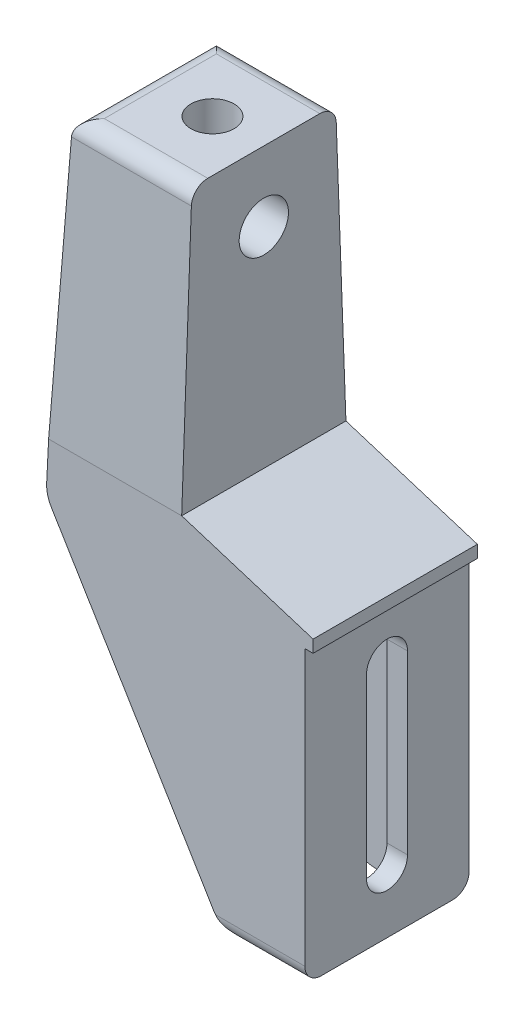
ISO-10303-21;
HEADER;
FILE_DESCRIPTION(('STEP AP214'),'2;1');
FILE_NAME('part.step','',(''),(''),'','','');
FILE_SCHEMA(('AUTOMOTIVE_DESIGN { 1 0 10303 214 1 1 1 1 }'));
ENDSEC;
DATA;
#1=APPLICATION_CONTEXT('core data for automotive mechanical design processes');
#2=APPLICATION_PROTOCOL_DEFINITION('international standard','automotive_design',2000,#1);
#3=PRODUCT_CONTEXT('',#1,'mechanical');
#4=PRODUCT('Part','Part','',(#3));
#5=PRODUCT_RELATED_PRODUCT_CATEGORY('part','',(#4));
#6=PRODUCT_DEFINITION_FORMATION('','',#4);
#7=PRODUCT_DEFINITION_CONTEXT('part definition',#1,'design');
#8=PRODUCT_DEFINITION('design','',#6,#7);
#9=PRODUCT_DEFINITION_SHAPE('','',#8);
#10=(LENGTH_UNIT() NAMED_UNIT(*) SI_UNIT(.MILLI.,.METRE.));
#11=(NAMED_UNIT(*) PLANE_ANGLE_UNIT() SI_UNIT($,.RADIAN.));
#12=(NAMED_UNIT(*) SI_UNIT($,.STERADIAN.) SOLID_ANGLE_UNIT());
#13=UNCERTAINTY_MEASURE_WITH_UNIT(LENGTH_MEASURE(1.E-05),#10,'distance_accuracy_value','');
#14=(GEOMETRIC_REPRESENTATION_CONTEXT(3) GLOBAL_UNCERTAINTY_ASSIGNED_CONTEXT((#13)) GLOBAL_UNIT_ASSIGNED_CONTEXT((#10,
#11,#12)) REPRESENTATION_CONTEXT('',''));
#15=CARTESIAN_POINT('',(0.,0.,0.));
#16=DIRECTION('',(0.,0.,1.));
#17=DIRECTION('',(1.,0.,0.));
#18=AXIS2_PLACEMENT_3D('',#15,#16,#17);
#19=CARTESIAN_POINT('',(53.7427424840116,0.787862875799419,-100.));
#20=DIRECTION('',(-0.0499376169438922,-0.998752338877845,0.));
#21=DIRECTION('',(0.998752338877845,-0.0499376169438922,0.));
#22=AXIS2_PLACEMENT_3D('',#19,#20,#21);
#23=PLANE('',#22);
#24=DIRECTION('',(0.,0.,1.));
#25=VECTOR('',#24,1.);
#26=CARTESIAN_POINT('',(64.5,0.25,-100.));
#27=LINE('',#26,#25);
#28=CARTESIAN_POINT('',(64.5,0.25,-37.5000000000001));
#29=VERTEX_POINT('',#28);
#30=CARTESIAN_POINT('',(64.5,0.25,-12.5));
#31=VERTEX_POINT('',#30);
#32=EDGE_CURVE('E443',#29,#31,#27,.T.);
#33=ORIENTED_EDGE('',*,*,#32,.F.);
#34=DIRECTION('',(-0.998752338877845,0.0499376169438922,0.));
#35=VECTOR('',#34,1.);
#36=CARTESIAN_POINT('',(53.7427424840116,0.787862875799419,-37.5000000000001));
#37=LINE('',#36,#35);
#38=CARTESIAN_POINT('',(53.7427424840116,0.787862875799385,-37.5));
#39=VERTEX_POINT('',#38);
#40=EDGE_CURVE('E445',#29,#39,#37,.T.);
#41=ORIENTED_EDGE('',*,*,#40,.T.);
#42=DIRECTION('',(0.,0.,1.));
#43=VECTOR('',#42,1.);
#44=CARTESIAN_POINT('',(53.7427424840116,0.787862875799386,-100.));
#45=LINE('',#44,#43);
#46=CARTESIAN_POINT('',(53.7427424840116,0.787862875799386,-43.3837313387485));
#47=VERTEX_POINT('',#46);
#48=EDGE_CURVE('E614',#47,#39,#45,.T.);
#49=ORIENTED_EDGE('',*,*,#48,.F.);
#50=CARTESIAN_POINT('',(-10.5000000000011,4.00000000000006,-41.));
#51=DIRECTION('',(-0.0499376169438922,-0.998752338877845,0.));
#52=DIRECTION('',(-0.998752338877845,0.0499376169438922,0.));
#53=AXIS2_PLACEMENT_3D('',#50,#51,#52);
#54=ELLIPSE('',#53,80.0999375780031,4.);
#55=CARTESIAN_POINT('',(69.5,0.,-41.));
#56=VERTEX_POINT('',#55);
#57=EDGE_CURVE('E592',#56,#47,#54,.F.);
#58=ORIENTED_EDGE('',*,*,#57,.F.);
#59=DIRECTION('',(0.,0.,1.));
#60=VECTOR('',#59,1.);
#61=CARTESIAN_POINT('',(69.5,0.,-100.));
#62=LINE('',#61,#60);
#63=CARTESIAN_POINT('',(69.5,0.,-9.00000000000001));
#64=VERTEX_POINT('',#63);
#65=EDGE_CURVE('E611',#56,#64,#62,.T.);
#66=ORIENTED_EDGE('',*,*,#65,.T.);
#67=CARTESIAN_POINT('',(-10.4999999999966,3.99999999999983,-9.));
#68=DIRECTION('',(-0.0499376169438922,-0.998752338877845,0.));
#69=DIRECTION('',(-0.998752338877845,0.0499376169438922,0.));
#70=AXIS2_PLACEMENT_3D('',#67,#68,#69);
#71=ELLIPSE('',#70,80.0999375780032,4.);
#72=CARTESIAN_POINT('',(53.7427424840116,0.787862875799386,-6.61626866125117));
#73=VERTEX_POINT('',#72);
#74=EDGE_CURVE('E586',#73,#64,#71,.F.);
#75=ORIENTED_EDGE('',*,*,#74,.F.);
#76=CARTESIAN_POINT('',(53.7427424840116,0.787862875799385,-12.5));
#77=VERTEX_POINT('',#76);
#78=EDGE_CURVE('E616',#77,#73,#45,.T.);
#79=ORIENTED_EDGE('',*,*,#78,.F.);
#80=DIRECTION('',(0.998752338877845,-0.0499376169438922,0.));
#81=VECTOR('',#80,1.);
#82=CARTESIAN_POINT('',(53.7427424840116,0.787862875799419,-12.5));
#83=LINE('',#82,#81);
#84=EDGE_CURVE('E448',#77,#31,#83,.T.);
#85=ORIENTED_EDGE('',*,*,#84,.T.);
#86=EDGE_LOOP('',(#33,#41,#49,#58,#66,#75,#79,#85));
#87=FACE_BOUND('',#86,.T.);
#88=ADVANCED_FACE('F97',(#87),#23,.T.);
#89=CARTESIAN_POINT('',(54.1422434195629,8.77788158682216,-100.));
#90=DIRECTION('',(0.,0.,1.));
#91=DIRECTION('',(1.,0.,0.));
#92=AXIS2_PLACEMENT_3D('',#89,#90,#91);
#93=CYLINDRICAL_SURFACE('',#92,8.00000000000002);
#94=ORIENTED_EDGE('',*,*,#48,.T.);
#95=CARTESIAN_POINT('',(54.1422434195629,8.77788158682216,-37.5));
#96=DIRECTION('',(0.,0.,1.));
#97=DIRECTION('',(0.,-1.,0.));
#98=AXIS2_PLACEMENT_3D('',#95,#96,#97);
#99=CIRCLE('',#98,8.00000000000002);
#100=CARTESIAN_POINT('',(47.2993665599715,4.63360405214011,-37.5000000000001));
#101=VERTEX_POINT('',#100);
#102=EDGE_CURVE('E474',#39,#101,#99,.F.);
#103=ORIENTED_EDGE('',*,*,#102,.T.);
#104=DIRECTION('',(0.,0.,1.));
#105=VECTOR('',#104,1.);
#106=CARTESIAN_POINT('',(47.2993665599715,4.63360405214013,-100.));
#107=LINE('',#106,#105);
#108=CARTESIAN_POINT('',(47.2993665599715,4.63360405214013,-45.));
#109=VERTEX_POINT('',#108);
#110=EDGE_CURVE('E617',#109,#101,#107,.T.);
#111=ORIENTED_EDGE('',*,*,#110,.F.);
#112=CARTESIAN_POINT('',(54.1422434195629,8.77788158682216,-45.));
#113=DIRECTION('',(0.,0.,1.));
#114=DIRECTION('',(1.,0.,0.));
#115=AXIS2_PLACEMENT_3D('',#112,#113,#114);
#116=CIRCLE('',#115,8.00000000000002);
#117=CARTESIAN_POINT('',(47.7257141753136,4.00000000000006,-45.));
#118=VERTEX_POINT('',#117);
#119=EDGE_CURVE('E559',#118,#109,#116,.F.);
#120=ORIENTED_EDGE('',*,*,#119,.F.);
#121=CARTESIAN_POINT('',(53.7427424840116,0.787862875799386,-43.3837313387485));
#122=CARTESIAN_POINT('',(53.6576396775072,0.792116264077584,-43.3894539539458));
#123=CARTESIAN_POINT('',(53.5727481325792,0.797725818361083,-43.3969905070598));
#124=CARTESIAN_POINT('',(53.4035823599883,0.811604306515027,-43.4154245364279));
#125=CARTESIAN_POINT('',(53.319307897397,0.819872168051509,-43.4263206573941));
#126=CARTESIAN_POINT('',(53.0681168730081,0.848531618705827,-43.4635807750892));
#127=CARTESIAN_POINT('',(52.9023060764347,0.872805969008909,-43.494555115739));
#128=CARTESIAN_POINT('',(52.5748048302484,0.931175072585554,-43.5660129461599));
#129=CARTESIAN_POINT('',(52.4131098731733,0.965258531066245,-43.6064854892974));
#130=CARTESIAN_POINT('',(52.0937401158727,1.04285337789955,-43.694200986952));
#131=CARTESIAN_POINT('',(51.9360693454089,1.08637383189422,-43.7414504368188));
#132=CARTESIAN_POINT('',(51.5556953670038,1.20390275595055,-43.8621180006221));
#133=CARTESIAN_POINT('',(51.3352459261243,1.28286348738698,-43.9378308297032));
#134=CARTESIAN_POINT('',(50.9028306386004,1.45936118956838,-44.0917461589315));
#135=CARTESIAN_POINT('',(50.6908662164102,1.55690126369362,-44.1699490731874));
#136=CARTESIAN_POINT('',(50.2758013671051,1.77038618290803,-44.3235674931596));
#137=CARTESIAN_POINT('',(50.0726874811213,1.88630174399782,-44.3989872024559));
#138=CARTESIAN_POINT('',(49.6755619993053,2.1368101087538,-44.5425083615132));
#139=CARTESIAN_POINT('',(49.4815483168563,2.27139860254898,-44.6106114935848));
#140=CARTESIAN_POINT('',(49.148076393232,2.52557398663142,-44.720279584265));
#141=CARTESIAN_POINT('',(49.00648381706,2.64129084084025,-44.7643242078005));
#142=CARTESIAN_POINT('',(48.7302341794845,2.88348847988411,-44.8431249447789));
#143=CARTESIAN_POINT('',(48.5955716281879,3.00996052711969,-44.8778885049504));
#144=CARTESIAN_POINT('',(48.3329042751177,3.27455525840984,-44.9360167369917));
#145=CARTESIAN_POINT('',(48.2049698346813,3.41277207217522,-44.9592766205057));
#146=CARTESIAN_POINT('',(48.0199367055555,3.62750928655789,-44.9832724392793));
#147=CARTESIAN_POINT('',(47.9593220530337,3.70043324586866,-44.9894563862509));
#148=CARTESIAN_POINT('',(47.8405939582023,3.84855765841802,-44.9978204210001));
#149=CARTESIAN_POINT('',(47.782481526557,3.9237590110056,-44.9999989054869));
#150=CARTESIAN_POINT('',(47.7257141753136,4.00000000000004,-45.));
#151=B_SPLINE_CURVE_WITH_KNOTS('',3,(#121,#122,#123,#124,#125,#126,#127,#128,#129,#130,#131,
#132,#133,#134,#135,#136,#137,#138,#139,#140,#141,#142,#143,#144,#145,#146,#147,#148,#149,#150),
.UNSPECIFIED.,.F.,.F.,(4,2,2,2,2,2,2,2,2,2,2,2,2,2,4),(0.,0.256136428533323,0.512169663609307,
1.02265712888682,1.53255912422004,2.04295314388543,2.78027201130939,3.51771414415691,
4.25399265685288,4.99010151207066,5.5537940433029,6.11703292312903,6.68531202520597,
6.97026730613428,7.2553366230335),.UNSPECIFIED.);
#152=EDGE_CURVE('E365',#47,#118,#151,.T.);
#153=ORIENTED_EDGE('',*,*,#152,.F.);
#154=EDGE_LOOP('',(#94,#103,#111,#120,#153));
#155=FACE_BOUND('',#154,.T.);
#156=ADVANCED_FACE('F371',(#155),#93,.T.);
#157=CARTESIAN_POINT('',(47.2993665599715,4.63360405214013,-12.5));
#158=VERTEX_POINT('',#157);
#159=CARTESIAN_POINT('',(47.2993665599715,4.63360405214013,-5.));
#160=VERTEX_POINT('',#159);
#161=EDGE_CURVE('E620',#158,#160,#107,.T.);
#162=ORIENTED_EDGE('',*,*,#161,.F.);
#163=CARTESIAN_POINT('',(54.1422434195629,8.77788158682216,-12.5));
#164=DIRECTION('',(0.,0.,-1.));
#165=DIRECTION('',(0.,1.,0.));
#166=AXIS2_PLACEMENT_3D('',#163,#164,#165);
#167=CIRCLE('',#166,8.00000000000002);
#168=EDGE_CURVE('E464',#158,#77,#167,.F.);
#169=ORIENTED_EDGE('',*,*,#168,.T.);
#170=ORIENTED_EDGE('',*,*,#78,.T.);
#171=CARTESIAN_POINT('',(47.7257141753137,3.99999999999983,-5.));
#172=CARTESIAN_POINT('',(47.8281344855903,3.86239272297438,-5.00001045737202));
#173=CARTESIAN_POINT('',(47.9349346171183,3.72825886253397,-5.00709590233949));
#174=CARTESIAN_POINT('',(48.1560459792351,3.46804456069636,-5.0333769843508));
#175=CARTESIAN_POINT('',(48.2703407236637,3.34194757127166,-5.05254679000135));
#176=CARTESIAN_POINT('',(48.504542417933,3.0994544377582,-5.10074858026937));
#177=CARTESIAN_POINT('',(48.6243872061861,2.98297890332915,-5.12968707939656));
#178=CARTESIAN_POINT('',(48.8699363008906,2.75870896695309,-5.19567766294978));
#179=CARTESIAN_POINT('',(48.9956445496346,2.65092054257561,-5.23273526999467));
#180=CARTESIAN_POINT('',(49.2971348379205,2.40807861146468,-5.3273707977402));
#181=CARTESIAN_POINT('',(49.4750419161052,2.27668834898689,-5.38759105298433));
#182=CARTESIAN_POINT('',(49.8390760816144,2.03020759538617,-5.5158617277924));
#183=CARTESIAN_POINT('',(50.0252044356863,1.91511962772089,-5.58391335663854));
#184=CARTESIAN_POINT('',(50.4057009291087,1.70072752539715,-5.72436011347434));
#185=CARTESIAN_POINT('',(50.6000959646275,1.6014808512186,-5.79676979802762));
#186=CARTESIAN_POINT('',(50.9963272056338,1.41915919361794,-5.9417627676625));
#187=CARTESIAN_POINT('',(51.1981650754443,1.33608785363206,-6.01434608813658));
#188=CARTESIAN_POINT('',(51.5870825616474,1.19439886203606,-6.14745663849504));
#189=CARTESIAN_POINT('',(51.7733948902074,1.13410759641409,-6.2084384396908));
#190=CARTESIAN_POINT('',(52.1518845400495,1.0269386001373,-6.32286715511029));
#191=CARTESIAN_POINT('',(52.3440544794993,0.980044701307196,-6.37632311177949));
#192=CARTESIAN_POINT('',(52.7343240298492,0.900232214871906,-6.47110574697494));
#193=CARTESIAN_POINT('',(52.9324223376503,0.867310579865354,-6.5124350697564));
#194=CARTESIAN_POINT('',(53.2334572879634,0.829019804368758,-6.56169708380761));
#195=CARTESIAN_POINT('',(53.3346689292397,0.818093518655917,-6.57601249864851));
#196=CARTESIAN_POINT('',(53.5380618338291,0.800074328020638,-6.5998587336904));
#197=CARTESIAN_POINT('',(53.6402437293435,0.792984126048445,-6.60938617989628));
#198=CARTESIAN_POINT('',(53.7427424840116,0.787862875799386,-6.61626866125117));
#199=B_SPLINE_CURVE_WITH_KNOTS('',3,(#171,#172,#173,#174,#175,#176,#177,#178,#179,#180,#181,
#182,#183,#184,#185,#186,#187,#188,#189,#190,#191,#192,#193,#194,#195,#196,#197,#198),
.UNSPECIFIED.,.F.,.F.,(4,2,2,2,2,2,2,2,2,2,2,2,2,4),(0.,0.514136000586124,1.0271766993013,
1.53544063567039,2.04405137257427,2.7306963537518,3.41744750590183,4.10663569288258,
4.79597893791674,5.41070744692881,6.0246909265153,6.63854042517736,6.9467749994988,
7.25522647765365),.UNSPECIFIED.);
#200=CARTESIAN_POINT('',(47.7257141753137,3.99999999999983,-5.));
#201=VERTEX_POINT('',#200);
#202=EDGE_CURVE('E357',#201,#73,#199,.T.);
#203=ORIENTED_EDGE('',*,*,#202,.F.);
#204=CARTESIAN_POINT('',(54.1422434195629,8.77788158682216,-5.));
#205=DIRECTION('',(0.,0.,-1.));
#206=DIRECTION('',(-1.,0.,0.));
#207=AXIS2_PLACEMENT_3D('',#204,#205,#206);
#208=CIRCLE('',#207,8.00000000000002);
#209=EDGE_CURVE('E532',#160,#201,#208,.F.);
#210=ORIENTED_EDGE('',*,*,#209,.F.);
#211=EDGE_LOOP('',(#162,#169,#170,#203,#210));
#212=FACE_BOUND('',#211,.T.);
#213=ADVANCED_FACE('F438',(#212),#93,.T.);
#214=CARTESIAN_POINT('',(7.76952144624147,69.9038134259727,-100.));
#215=DIRECTION('',(-0.855359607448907,-0.518034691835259,0.));
#216=DIRECTION('',(0.518034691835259,-0.855359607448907,0.));
#217=AXIS2_PLACEMENT_3D('',#214,#215,#216);
#218=PLANE('',#217);
#219=ORIENTED_EDGE('',*,*,#110,.T.);
#220=DIRECTION('',(-0.518034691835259,0.855359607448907,0.));
#221=VECTOR('',#220,1.);
#222=CARTESIAN_POINT('',(7.76952144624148,69.9038134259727,-37.5));
#223=LINE('',#222,#221);
#224=CARTESIAN_POINT('',(7.76952144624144,69.9038134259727,-37.5));
#225=VERTEX_POINT('',#224);
#226=EDGE_CURVE('E471',#101,#225,#223,.T.);
#227=ORIENTED_EDGE('',*,*,#226,.T.);
#228=DIRECTION('',(0.,0.,1.));
#229=VECTOR('',#228,1.);
#230=CARTESIAN_POINT('',(7.76952144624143,69.9038134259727,-100.));
#231=LINE('',#230,#229);
#232=CARTESIAN_POINT('',(7.76952144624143,69.9038134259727,-45.));
#233=VERTEX_POINT('',#232);
#234=EDGE_CURVE('E621',#233,#225,#231,.T.);
#235=ORIENTED_EDGE('',*,*,#234,.F.);
#236=DIRECTION('',(-0.518034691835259,0.855359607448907,0.));
#237=VECTOR('',#236,1.);
#238=CARTESIAN_POINT('',(7.76952144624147,69.9038134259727,-45.));
#239=LINE('',#238,#237);
#240=EDGE_CURVE('E556',#109,#233,#239,.T.);
#241=ORIENTED_EDGE('',*,*,#240,.F.);
#242=EDGE_LOOP('',(#219,#227,#235,#241));
#243=FACE_BOUND('',#242,.T.);
#244=ADVANCED_FACE('F859',(#243),#218,.T.);
#245=CARTESIAN_POINT('',(7.76952144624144,69.9038134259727,-12.5));
#246=VERTEX_POINT('',#245);
#247=CARTESIAN_POINT('',(7.76952144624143,69.9038134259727,-5.));
#248=VERTEX_POINT('',#247);
#249=EDGE_CURVE('E624',#246,#248,#231,.T.);
#250=ORIENTED_EDGE('',*,*,#249,.F.);
#251=DIRECTION('',(0.518034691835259,-0.855359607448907,0.));
#252=VECTOR('',#251,1.);
#253=CARTESIAN_POINT('',(7.76952144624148,69.9038134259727,-12.5));
#254=LINE('',#253,#252);
#255=EDGE_CURVE('E456',#246,#158,#254,.T.);
#256=ORIENTED_EDGE('',*,*,#255,.T.);
#257=ORIENTED_EDGE('',*,*,#161,.T.);
#258=DIRECTION('',(0.518034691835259,-0.855359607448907,0.));
#259=VECTOR('',#258,1.);
#260=CARTESIAN_POINT('',(7.76952144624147,69.9038134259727,-5.));
#261=LINE('',#260,#259);
#262=EDGE_CURVE('E529',#248,#160,#261,.T.);
#263=ORIENTED_EDGE('',*,*,#262,.F.);
#264=EDGE_LOOP('',(#250,#256,#257,#263));
#265=FACE_BOUND('',#264,.T.);
#266=ADVANCED_FACE('F867',(#265),#218,.T.);
#267=CARTESIAN_POINT('',(14.6123983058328,74.0480909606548,-100.));
#268=DIRECTION('',(0.,0.,1.));
#269=DIRECTION('',(1.,0.,0.));
#270=AXIS2_PLACEMENT_3D('',#267,#268,#269);
#271=CYLINDRICAL_SURFACE('',#270,8.00000000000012);
#272=ORIENTED_EDGE('',*,*,#234,.T.);
#273=CARTESIAN_POINT('',(14.6123983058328,74.0480909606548,-37.5));
#274=DIRECTION('',(0.,0.,1.));
#275=DIRECTION('',(0.,-1.,0.));
#276=AXIS2_PLACEMENT_3D('',#273,#274,#275);
#277=CIRCLE('',#276,8.00000000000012);
#278=CARTESIAN_POINT('',(6.6223795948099,74.4475918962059,-37.5));
#279=VERTEX_POINT('',#278);
#280=EDGE_CURVE('E468',#225,#279,#277,.F.);
#281=ORIENTED_EDGE('',*,*,#280,.T.);
#282=DIRECTION('',(0.,0.,1.));
#283=VECTOR('',#282,1.);
#284=CARTESIAN_POINT('',(6.6223795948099,74.4475918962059,-100.));
#285=LINE('',#284,#283);
#286=CARTESIAN_POINT('',(6.6223795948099,74.4475918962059,-45.));
#287=VERTEX_POINT('',#286);
#288=EDGE_CURVE('E625',#287,#279,#285,.T.);
#289=ORIENTED_EDGE('',*,*,#288,.F.);
#290=CARTESIAN_POINT('',(14.6123983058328,74.0480909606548,-45.));
#291=DIRECTION('',(0.,0.,1.));
#292=DIRECTION('',(1.,0.,0.));
#293=AXIS2_PLACEMENT_3D('',#290,#291,#292);
#294=CIRCLE('',#293,8.00000000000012);
#295=EDGE_CURVE('E553',#233,#287,#294,.F.);
#296=ORIENTED_EDGE('',*,*,#295,.F.);
#297=EDGE_LOOP('',(#272,#281,#289,#296));
#298=FACE_BOUND('',#297,.T.);
#299=ADVANCED_FACE('F875',(#298),#271,.T.);
#300=CARTESIAN_POINT('',(6.6223795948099,74.4475918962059,-12.5));
#301=VERTEX_POINT('',#300);
#302=CARTESIAN_POINT('',(6.6223795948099,74.4475918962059,-5.));
#303=VERTEX_POINT('',#302);
#304=EDGE_CURVE('E627',#301,#303,#285,.T.);
#305=ORIENTED_EDGE('',*,*,#304,.F.);
#306=CARTESIAN_POINT('',(14.6123983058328,74.0480909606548,-12.5));
#307=DIRECTION('',(0.,0.,-1.));
#308=DIRECTION('',(0.,1.,0.));
#309=AXIS2_PLACEMENT_3D('',#306,#307,#308);
#310=CIRCLE('',#309,8.00000000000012);
#311=EDGE_CURVE('E452',#301,#246,#310,.F.);
#312=ORIENTED_EDGE('',*,*,#311,.T.);
#313=ORIENTED_EDGE('',*,*,#249,.T.);
#314=CARTESIAN_POINT('',(14.6123983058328,74.0480909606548,-5.));
#315=DIRECTION('',(0.,0.,-1.));
#316=DIRECTION('',(-1.,0.,0.));
#317=AXIS2_PLACEMENT_3D('',#314,#315,#316);
#318=CIRCLE('',#317,8.00000000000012);
#319=EDGE_CURVE('E335',#303,#248,#318,.F.);
#320=ORIENTED_EDGE('',*,*,#319,.F.);
#321=EDGE_LOOP('',(#305,#312,#313,#320));
#322=FACE_BOUND('',#321,.T.);
#323=ADVANCED_FACE('F883',(#322),#271,.T.);
#324=CARTESIAN_POINT('',(10.3099875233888,148.199750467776,-100.));
#325=DIRECTION('',(-0.998752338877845,0.0499376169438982,0.));
#326=DIRECTION('',(-0.0499376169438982,-0.998752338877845,0.));
#327=AXIS2_PLACEMENT_3D('',#324,#325,#326);
#328=PLANE('',#327);
#329=CARTESIAN_POINT('',(9.64999999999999,135.,-24.9999999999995));
#330=DIRECTION('',(-0.998752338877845,0.0499376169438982,0.));
#331=DIRECTION('',(-0.0499376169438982,-0.998752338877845,0.));
#332=AXIS2_PLACEMENT_3D('',#329,#330,#331);
#333=ELLIPSE('',#332,6.00749531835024,6.);
#334=CARTESIAN_POINT('',(9.34999999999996,129.,-24.9999999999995));
#335=VERTEX_POINT('',#334);
#336=EDGE_CURVE('E331',#335,#335,#333,.F.);
#337=ORIENTED_EDGE('',*,*,#336,.T.);
#338=EDGE_LOOP('',(#337));
#339=FACE_BOUND('',#338,.T.);
#340=ORIENTED_EDGE('',*,*,#288,.T.);
#341=DIRECTION('',(0.0499376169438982,0.998752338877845,0.));
#342=VECTOR('',#341,1.);
#343=CARTESIAN_POINT('',(10.3099875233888,148.199750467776,-37.5));
#344=LINE('',#343,#342);
#345=CARTESIAN_POINT('',(8.89999999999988,120.,-37.5));
#346=VERTEX_POINT('',#345);
#347=EDGE_CURVE('E1007',#279,#346,#344,.T.);
#348=ORIENTED_EDGE('',*,*,#347,.T.);
#349=DIRECTION('',(0.,0.,1.));
#350=VECTOR('',#349,1.);
#351=CARTESIAN_POINT('',(8.89999999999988,120.,-100.));
#352=LINE('',#351,#350);
#353=CARTESIAN_POINT('',(8.89999999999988,120.,-12.5));
#354=VERTEX_POINT('',#353);
#355=EDGE_CURVE('E1016',#346,#354,#352,.T.);
#356=ORIENTED_EDGE('',*,*,#355,.T.);
#357=DIRECTION('',(-0.0499376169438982,-0.998752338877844,0.));
#358=VECTOR('',#357,1.);
#359=CARTESIAN_POINT('',(10.3099875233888,148.199750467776,-12.5));
#360=LINE('',#359,#358);
#361=EDGE_CURVE('E1019',#354,#301,#360,.T.);
#362=ORIENTED_EDGE('',*,*,#361,.T.);
#363=ORIENTED_EDGE('',*,*,#304,.T.);
#364=DIRECTION('',(-0.0499376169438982,-0.998752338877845,0.));
#365=VECTOR('',#364,1.);
#366=CARTESIAN_POINT('',(10.3099875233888,148.199750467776,-5.));
#367=LINE('',#366,#365);
#368=CARTESIAN_POINT('',(7.09999999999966,84.0000000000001,-5.));
#369=VERTEX_POINT('',#368);
#370=EDGE_CURVE('E344',#369,#303,#367,.T.);
#371=ORIENTED_EDGE('',*,*,#370,.F.);
#372=DIRECTION('',(-0.0499039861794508,-0.998079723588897,0.0366941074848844));
#373=VECTOR('',#372,1.);
#374=CARTESIAN_POINT('',(10.479627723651,151.592554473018,-7.48502038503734));
#375=LINE('',#374,#373);
#376=CARTESIAN_POINT('',(10.3073479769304,148.146959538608,-7.35834410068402));
#377=VERTEX_POINT('',#376);
#378=EDGE_CURVE('E347',#377,#369,#375,.T.);
#379=ORIENTED_EDGE('',*,*,#378,.F.);
#380=CARTESIAN_POINT('',(10.3000000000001,148.,-11.3556435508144));
#381=DIRECTION('',(-0.998752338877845,0.0499376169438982,0.));
#382=DIRECTION('',(-0.0499376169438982,-0.998752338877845,0.));
#383=AXIS2_PLACEMENT_3D('',#380,#381,#382);
#384=ELLIPSE('',#383,4.0049968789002,4.00000000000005);
#385=CARTESIAN_POINT('',(10.3099875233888,148.199750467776,-7.36063419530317));
#386=VERTEX_POINT('',#385);
#387=EDGE_CURVE('E516',#386,#377,#384,.F.);
#388=ORIENTED_EDGE('',*,*,#387,.F.);
#389=DIRECTION('',(0.,0.,1.));
#390=VECTOR('',#389,1.);
#391=CARTESIAN_POINT('',(10.3099875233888,148.199750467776,-100.));
#392=LINE('',#391,#390);
#393=CARTESIAN_POINT('',(10.3099875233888,148.199750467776,-42.6393658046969));
#394=VERTEX_POINT('',#393);
#395=EDGE_CURVE('E628',#394,#386,#392,.T.);
#396=ORIENTED_EDGE('',*,*,#395,.F.);
#397=CARTESIAN_POINT('',(10.3000000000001,148.,-38.6443564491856));
#398=DIRECTION('',(-0.998752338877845,0.0499376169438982,0.));
#399=DIRECTION('',(-0.0499376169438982,-0.998752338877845,0.));
#400=AXIS2_PLACEMENT_3D('',#397,#398,#399);
#401=ELLIPSE('',#400,4.0049968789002,4.00000000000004);
#402=CARTESIAN_POINT('',(10.3073479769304,148.146959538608,-42.6416558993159));
#403=VERTEX_POINT('',#402);
#404=EDGE_CURVE('E338',#403,#394,#401,.F.);
#405=ORIENTED_EDGE('',*,*,#404,.F.);
#406=DIRECTION('',(0.0499039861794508,0.998079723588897,0.0366941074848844));
#407=VECTOR('',#406,1.);
#408=CARTESIAN_POINT('',(10.204950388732,146.09900777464,-42.7169482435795));
#409=LINE('',#408,#407);
#410=CARTESIAN_POINT('',(7.09999999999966,84.0000000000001,-45.));
#411=VERTEX_POINT('',#410);
#412=EDGE_CURVE('E351',#411,#403,#409,.T.);
#413=ORIENTED_EDGE('',*,*,#412,.F.);
#414=DIRECTION('',(0.0499376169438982,0.998752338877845,0.));
#415=VECTOR('',#414,1.);
#416=CARTESIAN_POINT('',(10.3099875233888,148.199750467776,-45.));
#417=LINE('',#416,#415);
#418=EDGE_CURVE('E354',#287,#411,#417,.T.);
#419=ORIENTED_EDGE('',*,*,#418,.F.);
#420=EDGE_LOOP('',(#340,#348,#356,#362,#363,#371,#379,#388,#396,#405,#413,#419));
#421=FACE_BOUND('',#420,.T.);
#422=ADVANCED_FACE('F417',(#339,#421),#328,.T.);
#423=CARTESIAN_POINT('',(39.5,84.,-100.));
#424=DIRECTION('',(1.,0.,0.));
#425=DIRECTION('',(0.,0.,-1.));
#426=AXIS2_PLACEMENT_3D('',#423,#424,#425);
#427=PLANE('',#426);
#428=CARTESIAN_POINT('',(39.5,135.,-24.9999999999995));
#429=DIRECTION('',(1.,0.,0.));
#430=DIRECTION('',(0.,0.,-1.));
#431=AXIS2_PLACEMENT_3D('',#428,#429,#430);
#432=CIRCLE('',#431,6.);
#433=CARTESIAN_POINT('',(39.5,135.,-30.9999999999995));
#434=VERTEX_POINT('',#433);
#435=EDGE_CURVE('E328',#434,#434,#432,.F.);
#436=ORIENTED_EDGE('',*,*,#435,.T.);
#437=EDGE_LOOP('',(#436));
#438=FACE_BOUND('',#437,.T.);
#439=DIRECTION('',(0.,-0.999324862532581,-0.0367398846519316));
#440=VECTOR('',#439,1.);
#441=CARTESIAN_POINT('',(39.5,81.980670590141,-45.074240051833));
#442=LINE('',#441,#440);
#443=CARTESIAN_POINT('',(39.5,148.146959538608,-42.6416558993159));
#444=VERTEX_POINT('',#443);
#445=CARTESIAN_POINT('',(39.5,84.,-45.));
#446=VERTEX_POINT('',#445);
#447=EDGE_CURVE('E550',#444,#446,#442,.T.);
#448=ORIENTED_EDGE('',*,*,#447,.F.);
#449=CARTESIAN_POINT('',(39.5,148.,-38.6443564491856));
#450=DIRECTION('',(1.,0.,0.));
#451=DIRECTION('',(0.,0.,-1.));
#452=AXIS2_PLACEMENT_3D('',#449,#450,#451);
#453=CIRCLE('',#452,4.00000000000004);
#454=CARTESIAN_POINT('',(39.5,152.,-38.6443564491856));
#455=VERTEX_POINT('',#454);
#456=EDGE_CURVE('E333',#455,#444,#453,.F.);
#457=ORIENTED_EDGE('',*,*,#456,.F.);
#458=DIRECTION('',(0.,0.,1.));
#459=VECTOR('',#458,1.);
#460=CARTESIAN_POINT('',(39.5,152.,-100.));
#461=LINE('',#460,#459);
#462=CARTESIAN_POINT('',(39.5,152.,-11.3556435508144));
#463=VERTEX_POINT('',#462);
#464=EDGE_CURVE('E348',#455,#463,#461,.T.);
#465=ORIENTED_EDGE('',*,*,#464,.T.);
#466=CARTESIAN_POINT('',(39.5,148.,-11.3556435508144));
#467=DIRECTION('',(1.,0.,0.));
#468=DIRECTION('',(0.,0.,-1.));
#469=AXIS2_PLACEMENT_3D('',#466,#467,#468);
#470=CIRCLE('',#469,4.00000000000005);
#471=CARTESIAN_POINT('',(39.5,148.146959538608,-7.35834410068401));
#472=VERTEX_POINT('',#471);
#473=EDGE_CURVE('E519',#472,#463,#470,.F.);
#474=ORIENTED_EDGE('',*,*,#473,.F.);
#475=DIRECTION('',(0.,0.999324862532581,-0.0367398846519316));
#476=VECTOR('',#475,1.);
#477=CARTESIAN_POINT('',(39.5,87.4879326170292,-5.12823281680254));
#478=LINE('',#477,#476);
#479=CARTESIAN_POINT('',(39.5,84.,-5.));
#480=VERTEX_POINT('',#479);
#481=EDGE_CURVE('E547',#480,#472,#478,.T.);
#482=ORIENTED_EDGE('',*,*,#481,.F.);
#483=DIRECTION('',(0.,0.,1.));
#484=VECTOR('',#483,1.);
#485=CARTESIAN_POINT('',(39.5,84.,-100.));
#486=LINE('',#485,#484);
#487=EDGE_CURVE('E599',#446,#480,#486,.T.);
#488=ORIENTED_EDGE('',*,*,#487,.F.);
#489=EDGE_LOOP('',(#448,#457,#465,#474,#482,#488));
#490=FACE_BOUND('',#489,.T.);
#491=ADVANCED_FACE('F413',(#438,#490),#427,.T.);
#492=CARTESIAN_POINT('',(71.5,74.,-100.));
#493=DIRECTION('',(0.298274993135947,0.95447997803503,0.));
#494=DIRECTION('',(-0.95447997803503,0.298274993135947,0.));
#495=AXIS2_PLACEMENT_3D('',#492,#493,#494);
#496=PLANE('',#495);
#497=DIRECTION('',(0.95447997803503,-0.298274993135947,0.));
#498=VECTOR('',#497,1.);
#499=CARTESIAN_POINT('',(71.5,74.,-45.));
#500=LINE('',#499,#498);
#501=CARTESIAN_POINT('',(71.5,74.,-45.));
#502=VERTEX_POINT('',#501);
#503=EDGE_CURVE('E571',#446,#502,#500,.T.);
#504=ORIENTED_EDGE('',*,*,#503,.F.);
#505=ORIENTED_EDGE('',*,*,#487,.T.);
#506=DIRECTION('',(-0.95447997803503,0.298274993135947,0.));
#507=VECTOR('',#506,1.);
#508=CARTESIAN_POINT('',(71.5,74.,-5.));
#509=LINE('',#508,#507);
#510=CARTESIAN_POINT('',(71.5,74.,-5.));
#511=VERTEX_POINT('',#510);
#512=EDGE_CURVE('E544',#511,#480,#509,.T.);
#513=ORIENTED_EDGE('',*,*,#512,.F.);
#514=DIRECTION('',(0.,0.,1.));
#515=VECTOR('',#514,1.);
#516=CARTESIAN_POINT('',(71.5,74.,-100.));
#517=LINE('',#516,#515);
#518=EDGE_CURVE('E602',#502,#511,#517,.T.);
#519=ORIENTED_EDGE('',*,*,#518,.F.);
#520=EDGE_LOOP('',(#504,#505,#513,#519));
#521=FACE_BOUND('',#520,.T.);
#522=ADVANCED_FACE('F416',(#521),#496,.T.);
#523=CARTESIAN_POINT('',(71.5,71.,-100.));
#524=DIRECTION('',(1.,0.,0.));
#525=DIRECTION('',(0.,0.,-1.));
#526=AXIS2_PLACEMENT_3D('',#523,#524,#525);
#527=PLANE('',#526);
#528=DIRECTION('',(0.,-1.,0.));
#529=VECTOR('',#528,1.);
#530=CARTESIAN_POINT('',(71.5,71.,-45.));
#531=LINE('',#530,#529);
#532=CARTESIAN_POINT('',(71.5,71.,-45.));
#533=VERTEX_POINT('',#532);
#534=EDGE_CURVE('E568',#502,#533,#531,.T.);
#535=ORIENTED_EDGE('',*,*,#534,.F.);
#536=ORIENTED_EDGE('',*,*,#518,.T.);
#537=DIRECTION('',(0.,1.,0.));
#538=VECTOR('',#537,1.);
#539=CARTESIAN_POINT('',(71.5,71.,-5.));
#540=LINE('',#539,#538);
#541=CARTESIAN_POINT('',(71.5,71.,-5.));
#542=VERTEX_POINT('',#541);
#543=EDGE_CURVE('E541',#542,#511,#540,.T.);
#544=ORIENTED_EDGE('',*,*,#543,.F.);
#545=DIRECTION('',(0.,0.,1.));
#546=VECTOR('',#545,1.);
#547=CARTESIAN_POINT('',(71.5,71.,-100.));
#548=LINE('',#547,#546);
#549=EDGE_CURVE('E605',#533,#542,#548,.T.);
#550=ORIENTED_EDGE('',*,*,#549,.F.);
#551=EDGE_LOOP('',(#535,#536,#544,#550));
#552=FACE_BOUND('',#551,.T.);
#553=ADVANCED_FACE('F421',(#552),#527,.T.);
#554=CARTESIAN_POINT('',(69.5,71.,-100.));
#555=DIRECTION('',(0.,-1.,0.));
#556=DIRECTION('',(0.,0.,-1.));
#557=AXIS2_PLACEMENT_3D('',#554,#555,#556);
#558=PLANE('',#557);
#559=DIRECTION('',(-1.,0.,0.));
#560=VECTOR('',#559,1.);
#561=CARTESIAN_POINT('',(69.5,71.,-45.));
#562=LINE('',#561,#560);
#563=CARTESIAN_POINT('',(69.5,71.,-45.));
#564=VERTEX_POINT('',#563);
#565=EDGE_CURVE('E565',#533,#564,#562,.T.);
#566=ORIENTED_EDGE('',*,*,#565,.F.);
#567=ORIENTED_EDGE('',*,*,#549,.T.);
#568=DIRECTION('',(1.,0.,0.));
#569=VECTOR('',#568,1.);
#570=CARTESIAN_POINT('',(69.5,71.,-5.));
#571=LINE('',#570,#569);
#572=CARTESIAN_POINT('',(69.5,71.,-5.));
#573=VERTEX_POINT('',#572);
#574=EDGE_CURVE('E538',#573,#542,#571,.T.);
#575=ORIENTED_EDGE('',*,*,#574,.F.);
#576=DIRECTION('',(0.,0.,1.));
#577=VECTOR('',#576,1.);
#578=CARTESIAN_POINT('',(69.5,71.,-100.));
#579=LINE('',#578,#577);
#580=EDGE_CURVE('E608',#564,#573,#579,.T.);
#581=ORIENTED_EDGE('',*,*,#580,.F.);
#582=EDGE_LOOP('',(#566,#567,#575,#581));
#583=FACE_BOUND('',#582,.T.);
#584=ADVANCED_FACE('F425',(#583),#558,.T.);
#585=CARTESIAN_POINT('',(69.5,0.,-100.));
#586=DIRECTION('',(1.,0.,0.));
#587=DIRECTION('',(0.,0.,-1.));
#588=AXIS2_PLACEMENT_3D('',#585,#586,#587);
#589=PLANE('',#588);
#590=DIRECTION('',(0.,-1.,0.));
#591=VECTOR('',#590,1.);
#592=CARTESIAN_POINT('',(69.5,0.,-29.9999999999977));
#593=LINE('',#592,#591);
#594=CARTESIAN_POINT('',(69.5,58.,-29.9999999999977));
#595=VERTEX_POINT('',#594);
#596=CARTESIAN_POINT('',(69.5,15.0000000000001,-29.9999999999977));
#597=VERTEX_POINT('',#596);
#598=EDGE_CURVE('E580',#595,#597,#593,.T.);
#599=ORIENTED_EDGE('',*,*,#598,.T.);
#600=CARTESIAN_POINT('',(69.5,15.0000000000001,-24.9999999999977));
#601=DIRECTION('',(1.,0.,0.));
#602=DIRECTION('',(0.,0.,-1.));
#603=AXIS2_PLACEMENT_3D('',#600,#601,#602);
#604=CIRCLE('',#603,5.);
#605=CARTESIAN_POINT('',(69.5,15.0000000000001,-19.9999999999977));
#606=VERTEX_POINT('',#605);
#607=EDGE_CURVE('E583',#597,#606,#604,.F.);
#608=ORIENTED_EDGE('',*,*,#607,.T.);
#609=DIRECTION('',(0.,1.,0.));
#610=VECTOR('',#609,1.);
#611=CARTESIAN_POINT('',(69.5,0.,-19.9999999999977));
#612=LINE('',#611,#610);
#613=CARTESIAN_POINT('',(69.5,58.,-19.9999999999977));
#614=VERTEX_POINT('',#613);
#615=EDGE_CURVE('E574',#606,#614,#612,.T.);
#616=ORIENTED_EDGE('',*,*,#615,.T.);
#617=CARTESIAN_POINT('',(69.5,58.,-24.9999999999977));
#618=DIRECTION('',(1.,0.,0.));
#619=DIRECTION('',(0.,0.,-1.));
#620=AXIS2_PLACEMENT_3D('',#617,#618,#619);
#621=CIRCLE('',#620,5.);
#622=EDGE_CURVE('E577',#614,#595,#621,.F.);
#623=ORIENTED_EDGE('',*,*,#622,.T.);
#624=EDGE_LOOP('',(#599,#608,#616,#623));
#625=FACE_BOUND('',#624,.T.);
#626=CARTESIAN_POINT('',(69.5,4.00000000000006,-41.));
#627=DIRECTION('',(1.,0.,0.));
#628=DIRECTION('',(0.,0.,-1.));
#629=AXIS2_PLACEMENT_3D('',#626,#627,#628);
#630=CIRCLE('',#629,4.);
#631=CARTESIAN_POINT('',(69.5,4.00000000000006,-45.));
#632=VERTEX_POINT('',#631);
#633=EDGE_CURVE('E595',#632,#56,#630,.F.);
#634=ORIENTED_EDGE('',*,*,#633,.F.);
#635=DIRECTION('',(0.,-1.,0.));
#636=VECTOR('',#635,1.);
#637=CARTESIAN_POINT('',(69.5,0.,-45.));
#638=LINE('',#637,#636);
#639=EDGE_CURVE('E562',#564,#632,#638,.T.);
#640=ORIENTED_EDGE('',*,*,#639,.F.);
#641=ORIENTED_EDGE('',*,*,#580,.T.);
#642=DIRECTION('',(0.,1.,0.));
#643=VECTOR('',#642,1.);
#644=CARTESIAN_POINT('',(69.5,0.,-5.));
#645=LINE('',#644,#643);
#646=CARTESIAN_POINT('',(69.5,3.99999999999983,-5.));
#647=VERTEX_POINT('',#646);
#648=EDGE_CURVE('E535',#647,#573,#645,.T.);
#649=ORIENTED_EDGE('',*,*,#648,.F.);
#650=CARTESIAN_POINT('',(69.5,3.99999999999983,-9.));
#651=DIRECTION('',(1.,0.,0.));
#652=DIRECTION('',(0.,0.,-1.));
#653=AXIS2_PLACEMENT_3D('',#650,#651,#652);
#654=CIRCLE('',#653,4.);
#655=EDGE_CURVE('E589',#64,#647,#654,.F.);
#656=ORIENTED_EDGE('',*,*,#655,.F.);
#657=ORIENTED_EDGE('',*,*,#65,.F.);
#658=EDGE_LOOP('',(#634,#640,#641,#649,#656,#657));
#659=FACE_BOUND('',#658,.T.);
#660=ADVANCED_FACE('F429',(#625,#659),#589,.T.);
#661=CARTESIAN_POINT('',(14.3049968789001,148.,-100.));
#662=DIRECTION('',(0.,0.,1.));
#663=DIRECTION('',(1.,0.,0.));
#664=AXIS2_PLACEMENT_3D('',#661,#662,#663);
#665=CYLINDRICAL_SURFACE('',#664,3.9999999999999);
#666=CARTESIAN_POINT('',(14.3049968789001,148.,-38.6443564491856));
#667=DIRECTION('',(-0.707106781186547,0.,0.707106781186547));
#668=DIRECTION('',(0.707106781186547,0.,0.707106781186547));
#669=AXIS2_PLACEMENT_3D('',#666,#667,#668);
#670=ELLIPSE('',#669,5.65685424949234,3.99999999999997);
#671=CARTESIAN_POINT('',(14.3049968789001,152.,-38.6443564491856));
#672=VERTEX_POINT('',#671);
#673=EDGE_CURVE('E522',#394,#672,#670,.F.);
#674=ORIENTED_EDGE('',*,*,#673,.F.);
#675=ORIENTED_EDGE('',*,*,#395,.T.);
#676=CARTESIAN_POINT('',(14.3049968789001,148.,-11.3556435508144));
#677=DIRECTION('',(0.707106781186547,0.,0.707106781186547));
#678=DIRECTION('',(-0.707106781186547,0.,0.707106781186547));
#679=AXIS2_PLACEMENT_3D('',#676,#677,#678);
#680=ELLIPSE('',#679,5.65685424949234,3.99999999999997);
#681=CARTESIAN_POINT('',(14.3049968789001,152.,-11.3556435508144));
#682=VERTEX_POINT('',#681);
#683=EDGE_CURVE('E513',#682,#386,#680,.T.);
#684=ORIENTED_EDGE('',*,*,#683,.F.);
#685=DIRECTION('',(0.,0.,1.));
#686=VECTOR('',#685,1.);
#687=CARTESIAN_POINT('',(14.3049968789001,152.,-100.));
#688=LINE('',#687,#686);
#689=EDGE_CURVE('E342',#672,#682,#688,.T.);
#690=ORIENTED_EDGE('',*,*,#689,.F.);
#691=EDGE_LOOP('',(#674,#675,#684,#690));
#692=FACE_BOUND('',#691,.T.);
#693=ADVANCED_FACE('F99',(#692),#665,.T.);
#694=CARTESIAN_POINT('',(39.5,152.,-100.));
#695=DIRECTION('',(0.,1.,0.));
#696=DIRECTION('',(0.,0.,1.));
#697=AXIS2_PLACEMENT_3D('',#694,#695,#696);
#698=PLANE('',#697);
#699=CARTESIAN_POINT('',(27.,152.,-25.));
#700=DIRECTION('',(0.,1.,0.));
#701=DIRECTION('',(0.,0.,1.));
#702=AXIS2_PLACEMENT_3D('',#699,#700,#701);
#703=CIRCLE('',#702,5.25);
#704=CARTESIAN_POINT('',(27.,152.,-19.75));
#705=VERTEX_POINT('',#704);
#706=EDGE_CURVE('E1032',#705,#705,#703,.T.);
#707=ORIENTED_EDGE('',*,*,#706,.F.);
#708=EDGE_LOOP('',(#707));
#709=FACE_BOUND('',#708,.T.);
#710=ORIENTED_EDGE('',*,*,#689,.T.);
#711=DIRECTION('',(-1.,0.,0.));
#712=VECTOR('',#711,1.);
#713=CARTESIAN_POINT('',(200.,152.,-11.3556435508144));
#714=LINE('',#713,#712);
#715=EDGE_CURVE('E499',#463,#682,#714,.T.);
#716=ORIENTED_EDGE('',*,*,#715,.F.);
#717=ORIENTED_EDGE('',*,*,#464,.F.);
#718=DIRECTION('',(-1.,0.,0.));
#719=VECTOR('',#718,1.);
#720=CARTESIAN_POINT('',(200.,152.,-38.6443564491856));
#721=LINE('',#720,#719);
#722=EDGE_CURVE('E502',#455,#672,#721,.T.);
#723=ORIENTED_EDGE('',*,*,#722,.T.);
#724=EDGE_LOOP('',(#710,#716,#717,#723));
#725=FACE_BOUND('',#724,.T.);
#726=ADVANCED_FACE('F394',(#709,#725),#698,.T.);
#727=CARTESIAN_POINT('',(200.,148.,-11.3556435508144));
#728=DIRECTION('',(-1.,0.,0.));
#729=DIRECTION('',(0.,0.,1.));
#730=AXIS2_PLACEMENT_3D('',#727,#728,#729);
#731=CYLINDRICAL_SURFACE('',#730,4.00000000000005);
#732=DIRECTION('',(-1.,0.,0.));
#733=VECTOR('',#732,1.);
#734=CARTESIAN_POINT('',(200.,148.146959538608,-7.35834410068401));
#735=LINE('',#734,#733);
#736=EDGE_CURVE('E496',#472,#377,#735,.T.);
#737=ORIENTED_EDGE('',*,*,#736,.F.);
#738=ORIENTED_EDGE('',*,*,#473,.T.);
#739=ORIENTED_EDGE('',*,*,#715,.T.);
#740=ORIENTED_EDGE('',*,*,#683,.T.);
#741=ORIENTED_EDGE('',*,*,#387,.T.);
#742=EDGE_LOOP('',(#737,#738,#739,#740,#741));
#743=FACE_BOUND('',#742,.T.);
#744=ADVANCED_FACE('F387',(#743),#731,.T.);
#745=CARTESIAN_POINT('',(200.,84.0000000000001,-5.));
#746=DIRECTION('',(0.,0.,-1.));
#747=DIRECTION('',(-1.,0.,0.));
#748=AXIS2_PLACEMENT_3D('',#745,#746,#747);
#749=PLANE('',#748);
#750=ORIENTED_EDGE('',*,*,#543,.T.);
#751=ORIENTED_EDGE('',*,*,#512,.T.);
#752=DIRECTION('',(-1.,0.,0.));
#753=VECTOR('',#752,1.);
#754=CARTESIAN_POINT('',(200.,84.0000000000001,-5.));
#755=LINE('',#754,#753);
#756=EDGE_CURVE('E493',#480,#369,#755,.T.);
#757=ORIENTED_EDGE('',*,*,#756,.T.);
#758=ORIENTED_EDGE('',*,*,#370,.T.);
#759=ORIENTED_EDGE('',*,*,#319,.T.);
#760=ORIENTED_EDGE('',*,*,#262,.T.);
#761=ORIENTED_EDGE('',*,*,#209,.T.);
#762=DIRECTION('',(-1.,0.,0.));
#763=VECTOR('',#762,1.);
#764=CARTESIAN_POINT('',(200.,3.99999999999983,-5.));
#765=LINE('',#764,#763);
#766=EDGE_CURVE('E490',#647,#201,#765,.T.);
#767=ORIENTED_EDGE('',*,*,#766,.F.);
#768=ORIENTED_EDGE('',*,*,#648,.T.);
#769=ORIENTED_EDGE('',*,*,#574,.T.);
#770=EDGE_LOOP('',(#750,#751,#757,#758,#759,#760,#761,#767,#768,#769));
#771=FACE_BOUND('',#770,.T.);
#772=ADVANCED_FACE('F384',(#771),#749,.F.);
#773=CARTESIAN_POINT('',(200.,84.0000000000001,-5.));
#774=DIRECTION('',(0.,-0.0367398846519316,-0.999324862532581));
#775=DIRECTION('',(0.,0.999324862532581,-0.0367398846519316));
#776=AXIS2_PLACEMENT_3D('',#773,#774,#775);
#777=PLANE('',#776);
#778=ORIENTED_EDGE('',*,*,#756,.F.);
#779=ORIENTED_EDGE('',*,*,#481,.T.);
#780=ORIENTED_EDGE('',*,*,#736,.T.);
#781=ORIENTED_EDGE('',*,*,#378,.T.);
#782=EDGE_LOOP('',(#778,#779,#780,#781));
#783=FACE_BOUND('',#782,.T.);
#784=ADVANCED_FACE('F380',(#783),#777,.F.);
#785=CARTESIAN_POINT('',(200.,3.99999999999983,-9.));
#786=DIRECTION('',(-1.,0.,0.));
#787=DIRECTION('',(0.,0.,1.));
#788=AXIS2_PLACEMENT_3D('',#785,#786,#787);
#789=CYLINDRICAL_SURFACE('',#788,4.);
#790=ORIENTED_EDGE('',*,*,#74,.T.);
#791=ORIENTED_EDGE('',*,*,#655,.T.);
#792=ORIENTED_EDGE('',*,*,#766,.T.);
#793=ORIENTED_EDGE('',*,*,#202,.T.);
#794=EDGE_LOOP('',(#790,#791,#792,#793));
#795=FACE_BOUND('',#794,.T.);
#796=ADVANCED_FACE('F375',(#795),#789,.T.);
#797=CARTESIAN_POINT('',(200.,148.,-38.6443564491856));
#798=DIRECTION('',(-1.,0.,0.));
#799=DIRECTION('',(0.,0.,1.));
#800=AXIS2_PLACEMENT_3D('',#797,#798,#799);
#801=CYLINDRICAL_SURFACE('',#800,4.00000000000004);
#802=ORIENTED_EDGE('',*,*,#722,.F.);
#803=ORIENTED_EDGE('',*,*,#456,.T.);
#804=DIRECTION('',(-1.,0.,0.));
#805=VECTOR('',#804,1.);
#806=CARTESIAN_POINT('',(200.,148.146959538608,-42.6416558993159));
#807=LINE('',#806,#805);
#808=EDGE_CURVE('E504',#444,#403,#807,.T.);
#809=ORIENTED_EDGE('',*,*,#808,.T.);
#810=ORIENTED_EDGE('',*,*,#404,.T.);
#811=ORIENTED_EDGE('',*,*,#673,.T.);
#812=EDGE_LOOP('',(#802,#803,#809,#810,#811));
#813=FACE_BOUND('',#812,.T.);
#814=ADVANCED_FACE('F379',(#813),#801,.T.);
#815=CARTESIAN_POINT('',(200.,84.0000000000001,-45.));
#816=DIRECTION('',(0.,-0.0367398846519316,0.999324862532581));
#817=DIRECTION('',(0.,-0.999324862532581,-0.0367398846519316));
#818=AXIS2_PLACEMENT_3D('',#815,#816,#817);
#819=PLANE('',#818);
#820=ORIENTED_EDGE('',*,*,#808,.F.);
#821=ORIENTED_EDGE('',*,*,#447,.T.);
#822=DIRECTION('',(-1.,0.,0.));
#823=VECTOR('',#822,1.);
#824=CARTESIAN_POINT('',(200.,84.0000000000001,-45.));
#825=LINE('',#824,#823);
#826=EDGE_CURVE('E507',#446,#411,#825,.T.);
#827=ORIENTED_EDGE('',*,*,#826,.T.);
#828=ORIENTED_EDGE('',*,*,#412,.T.);
#829=EDGE_LOOP('',(#820,#821,#827,#828));
#830=FACE_BOUND('',#829,.T.);
#831=ADVANCED_FACE('F398',(#830),#819,.F.);
#832=CARTESIAN_POINT('',(200.,84.0000000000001,-45.));
#833=DIRECTION('',(0.,0.,1.));
#834=DIRECTION('',(1.,0.,0.));
#835=AXIS2_PLACEMENT_3D('',#832,#833,#834);
#836=PLANE('',#835);
#837=ORIENTED_EDGE('',*,*,#826,.F.);
#838=ORIENTED_EDGE('',*,*,#503,.T.);
#839=ORIENTED_EDGE('',*,*,#534,.T.);
#840=ORIENTED_EDGE('',*,*,#565,.T.);
#841=ORIENTED_EDGE('',*,*,#639,.T.);
#842=DIRECTION('',(-1.,0.,0.));
#843=VECTOR('',#842,1.);
#844=CARTESIAN_POINT('',(200.,4.00000000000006,-45.));
#845=LINE('',#844,#843);
#846=EDGE_CURVE('E510',#632,#118,#845,.T.);
#847=ORIENTED_EDGE('',*,*,#846,.T.);
#848=ORIENTED_EDGE('',*,*,#119,.T.);
#849=ORIENTED_EDGE('',*,*,#240,.T.);
#850=ORIENTED_EDGE('',*,*,#295,.T.);
#851=ORIENTED_EDGE('',*,*,#418,.T.);
#852=EDGE_LOOP('',(#837,#838,#839,#840,#841,#847,#848,#849,#850,#851));
#853=FACE_BOUND('',#852,.T.);
#854=ADVANCED_FACE('F402',(#853),#836,.F.);
#855=CARTESIAN_POINT('',(200.,4.00000000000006,-41.));
#856=DIRECTION('',(-1.,0.,0.));
#857=DIRECTION('',(0.,0.,1.));
#858=AXIS2_PLACEMENT_3D('',#855,#856,#857);
#859=CYLINDRICAL_SURFACE('',#858,4.);
#860=ORIENTED_EDGE('',*,*,#846,.F.);
#861=ORIENTED_EDGE('',*,*,#633,.T.);
#862=ORIENTED_EDGE('',*,*,#57,.T.);
#863=ORIENTED_EDGE('',*,*,#152,.T.);
#864=EDGE_LOOP('',(#860,#861,#862,#863));
#865=FACE_BOUND('',#864,.T.);
#866=ADVANCED_FACE('F320',(#865),#859,.T.);
#867=CARTESIAN_POINT('',(200.,135.,-24.9999999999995));
#868=DIRECTION('',(-1.,0.,0.));
#869=DIRECTION('',(0.,0.,1.));
#870=AXIS2_PLACEMENT_3D('',#867,#868,#869);
#871=CYLINDRICAL_SURFACE('',#870,6.);
#872=CARTESIAN_POINT('',(27.,137.904737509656,-19.75));
#873=CARTESIAN_POINT('',(26.9154950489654,137.904719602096,-19.7499941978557));
#874=CARTESIAN_POINT('',(26.8310311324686,137.908440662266,-19.7520445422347));
#875=CARTESIAN_POINT('',(26.6629142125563,137.923033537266,-19.7601573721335));
#876=CARTESIAN_POINT('',(26.5792613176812,137.933906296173,-19.7662203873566));
#877=CARTESIAN_POINT('',(26.3301755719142,137.976481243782,-19.7902358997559));
#878=CARTESIAN_POINT('',(26.1669400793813,138.018136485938,-19.8140138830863));
#879=CARTESIAN_POINT('',(25.8938324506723,138.106320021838,-19.8665223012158));
#880=CARTESIAN_POINT('',(25.7817278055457,138.148284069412,-19.8920446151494));
#881=CARTESIAN_POINT('',(25.5621765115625,138.239582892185,-19.9494537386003));
#882=CARTESIAN_POINT('',(25.4547325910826,138.288921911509,-19.9813442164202));
#883=CARTESIAN_POINT('',(25.2441164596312,138.392963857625,-20.0510882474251));
#884=CARTESIAN_POINT('',(25.1409573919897,138.447681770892,-20.0889586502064));
#885=CARTESIAN_POINT('',(24.9388838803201,138.560716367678,-20.1702839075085));
#886=CARTESIAN_POINT('',(24.8399707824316,138.619034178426,-20.2137405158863));
#887=CARTESIAN_POINT('',(24.5889115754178,138.773058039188,-20.333274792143));
#888=CARTESIAN_POINT('',(24.4397907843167,138.870522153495,-20.4134713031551));
#889=CARTESIAN_POINT('',(24.1508309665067,139.067448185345,-20.5871605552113));
#890=CARTESIAN_POINT('',(24.0109970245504,139.166911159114,-20.6806604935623));
#891=CARTESIAN_POINT('',(23.7406596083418,139.364899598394,-20.8808440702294));
#892=CARTESIAN_POINT('',(23.6101465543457,139.463425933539,-20.9875138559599));
#893=CARTESIAN_POINT('',(23.358770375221,139.657217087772,-21.2141612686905));
#894=CARTESIAN_POINT('',(23.2379029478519,139.752483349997,-21.3341329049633));
#895=CARTESIAN_POINT('',(22.9443072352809,139.98745548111,-21.655825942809));
#896=CARTESIAN_POINT('',(22.7786137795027,140.123531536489,-21.8668329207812));
#897=CARTESIAN_POINT('',(22.4772413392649,140.374566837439,-22.320256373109));
#898=CARTESIAN_POINT('',(22.3415113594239,140.489561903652,-22.562618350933));
#899=CARTESIAN_POINT('',(22.1289955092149,140.671132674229,-23.02811701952));
#900=CARTESIAN_POINT('',(22.0459318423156,140.742742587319,-23.2463597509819));
#901=CARTESIAN_POINT('',(21.9429182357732,140.831919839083,-23.5849380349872));
#902=CARTESIAN_POINT('',(21.9121718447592,140.858610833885,-23.6996997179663));
#903=CARTESIAN_POINT('',(21.8583334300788,140.905425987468,-23.9322973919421));
#904=CARTESIAN_POINT('',(21.8352381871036,140.925552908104,-24.0501320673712));
#905=CARTESIAN_POINT('',(21.7969929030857,140.958917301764,-24.2887332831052));
#906=CARTESIAN_POINT('',(21.7818877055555,140.972115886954,-24.4095124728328));
#907=CARTESIAN_POINT('',(21.7601004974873,140.991161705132,-24.6524101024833));
#908=CARTESIAN_POINT('',(21.7534185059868,140.997008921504,-24.7745285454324));
#909=CARTESIAN_POINT('',(21.7486108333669,141.001215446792,-25.0190446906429));
#910=CARTESIAN_POINT('',(21.7504838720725,140.99957587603,-25.141442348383));
#911=CARTESIAN_POINT('',(21.7627454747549,140.988850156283,-25.385474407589));
#912=CARTESIAN_POINT('',(21.7731335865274,140.979764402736,-25.5071088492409));
#913=CARTESIAN_POINT('',(21.8009804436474,140.955439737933,-25.7382865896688));
#914=CARTESIAN_POINT('',(21.8177593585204,140.940792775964,-25.8479751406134));
#915=CARTESIAN_POINT('',(21.8580073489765,140.905716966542,-26.0651915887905));
#916=CARTESIAN_POINT('',(21.8814786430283,140.885286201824,-26.1727187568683));
#917=CARTESIAN_POINT('',(21.9614427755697,140.815827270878,-26.4910383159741));
#918=CARTESIAN_POINT('',(22.0275084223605,140.758612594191,-26.6977501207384));
#919=CARTESIAN_POINT('',(22.1871426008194,140.621327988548,-27.1097652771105));
#920=CARTESIAN_POINT('',(22.2822786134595,140.53996620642,-27.3140125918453));
#921=CARTESIAN_POINT('',(22.4940132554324,140.360804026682,-27.70327834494));
#922=CARTESIAN_POINT('',(22.6106244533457,140.262994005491,-27.8882854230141));
#923=CARTESIAN_POINT('',(22.8315389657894,140.080422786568,-28.1958013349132));
#924=CARTESIAN_POINT('',(22.932032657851,139.998199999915,-28.3226250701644));
#925=CARTESIAN_POINT('',(23.1423068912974,139.828604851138,-28.5646027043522));
#926=CARTESIAN_POINT('',(23.2520881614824,139.741232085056,-28.6797556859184));
#927=CARTESIAN_POINT('',(23.4804329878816,139.562866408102,-28.8987501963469));
#928=CARTESIAN_POINT('',(23.5990203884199,139.471864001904,-29.0025589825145));
#929=CARTESIAN_POINT('',(23.8442282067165,139.288329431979,-29.1986001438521));
#930=CARTESIAN_POINT('',(23.9708464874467,139.195797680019,-29.2908355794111));
#931=CARTESIAN_POINT('',(24.2137317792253,139.024236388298,-29.4516671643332));
#932=CARTESIAN_POINT('',(24.3289573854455,138.945134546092,-29.5217642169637));
#933=CARTESIAN_POINT('',(24.5655650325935,138.788939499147,-29.6534250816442));
#934=CARTESIAN_POINT('',(24.6869487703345,138.711846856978,-29.7149865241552));
#935=CARTESIAN_POINT('',(24.9359332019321,138.562021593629,-29.8291655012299));
#936=CARTESIAN_POINT('',(25.0635154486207,138.489277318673,-29.8818077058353));
#937=CARTESIAN_POINT('',(25.3257299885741,138.350865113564,-29.9778297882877));
#938=CARTESIAN_POINT('',(25.4603560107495,138.285191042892,-30.0212177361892));
#939=CARTESIAN_POINT('',(25.7463529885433,138.160924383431,-30.1004232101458));
#940=CARTESIAN_POINT('',(25.8982435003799,138.10307097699,-30.1355641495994));
#941=CARTESIAN_POINT('',(26.2103530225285,138.006544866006,-30.1926783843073));
#942=CARTESIAN_POINT('',(26.3705496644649,137.967823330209,-30.2146852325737));
#943=CARTESIAN_POINT('',(26.6159295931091,137.928875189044,-30.2365920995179));
#944=CARTESIAN_POINT('',(26.6991542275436,137.919081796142,-30.2420420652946));
#945=CARTESIAN_POINT('',(26.8663154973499,137.906621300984,-30.2489628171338));
#946=CARTESIAN_POINT('',(26.9502520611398,137.903953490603,-30.2504339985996));
#947=CARTESIAN_POINT('',(27.1180080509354,137.90592253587,-30.2493441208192));
#948=CARTESIAN_POINT('',(27.2018274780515,137.910559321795,-30.2467831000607));
#949=CARTESIAN_POINT('',(27.3685964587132,137.926853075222,-30.2377110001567));
#950=CARTESIAN_POINT('',(27.4515455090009,137.938513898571,-30.2311977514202));
#951=CARTESIAN_POINT('',(27.6262606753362,137.970086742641,-30.2133435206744));
#952=CARTESIAN_POINT('',(27.717819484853,137.990853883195,-30.2014972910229));
#953=CARTESIAN_POINT('',(27.8984303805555,138.039259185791,-30.1733634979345));
#954=CARTESIAN_POINT('',(27.9874804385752,138.066902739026,-30.1570724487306));
#955=CARTESIAN_POINT('',(28.2508928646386,138.158321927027,-30.1019625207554));
#956=CARTESIAN_POINT('',(28.42106610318,138.230492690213,-30.0569559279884));
#957=CARTESIAN_POINT('',(28.7288488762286,138.377957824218,-29.9594565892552));
#958=CARTESIAN_POINT('',(28.8678269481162,138.451647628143,-29.9086790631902));
#959=CARTESIAN_POINT('',(29.1382625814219,138.605175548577,-29.7970536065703));
#960=CARTESIAN_POINT('',(29.2697145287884,138.685018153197,-29.7361982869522));
#961=CARTESIAN_POINT('',(29.5257661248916,138.848018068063,-29.6047527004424));
#962=CARTESIAN_POINT('',(29.6503557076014,138.931179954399,-29.5341486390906));
#963=CARTESIAN_POINT('',(29.8928208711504,139.098565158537,-29.3834291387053));
#964=CARTESIAN_POINT('',(30.0106981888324,139.182788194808,-29.3033161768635));
#965=CARTESIAN_POINT('',(30.2485797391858,139.357031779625,-29.1270786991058));
#966=CARTESIAN_POINT('',(30.3680609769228,139.447004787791,-29.0301991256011));
#967=CARTESIAN_POINT('',(30.5991075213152,139.624457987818,-28.8252806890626));
#968=CARTESIAN_POINT('',(30.710671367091,139.711937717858,-28.7172397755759));
#969=CARTESIAN_POINT('',(30.9250206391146,139.882529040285,-28.4901319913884));
#970=CARTESIAN_POINT('',(31.0278246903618,139.965649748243,-28.3710896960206));
#971=CARTESIAN_POINT('',(31.2239679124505,140.126034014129,-28.1218232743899));
#972=CARTESIAN_POINT('',(31.317306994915,140.203297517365,-27.9915990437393));
#973=CARTESIAN_POINT('',(31.5360314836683,140.385896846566,-27.6541466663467));
#974=CARTESIAN_POINT('',(31.6550716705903,140.486727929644,-27.4401463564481));
#975=CARTESIAN_POINT('',(31.8121800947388,140.620840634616,-27.1025886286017));
#976=CARTESIAN_POINT('',(31.8609862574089,140.662699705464,-26.9872708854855));
#977=CARTESIAN_POINT('',(31.9507948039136,140.739977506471,-26.7515728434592));
#978=CARTESIAN_POINT('',(31.9918011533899,140.775399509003,-26.6311951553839));
#979=CARTESIAN_POINT('',(32.0657001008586,140.839389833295,-26.3848734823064));
#980=CARTESIAN_POINT('',(32.0985124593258,140.86789030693,-26.2588876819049));
#981=CARTESIAN_POINT('',(32.1548798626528,140.916932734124,-26.0034000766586));
#982=CARTESIAN_POINT('',(32.178439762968,140.937478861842,-25.8739001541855));
#983=CARTESIAN_POINT('',(32.2158182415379,140.970106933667,-25.6125050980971));
#984=CARTESIAN_POINT('',(32.2296414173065,140.982192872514,-25.4806111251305));
#985=CARTESIAN_POINT('',(32.2472482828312,140.997590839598,-25.2156519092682));
#986=CARTESIAN_POINT('',(32.2510333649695,141.000904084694,-25.0825868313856));
#987=CARTESIAN_POINT('',(32.2486549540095,140.998823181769,-24.8345669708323));
#988=CARTESIAN_POINT('',(32.2437629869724,140.99454191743,-24.7195873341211));
#989=CARTESIAN_POINT('',(32.2264890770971,140.979437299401,-24.4905888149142));
#990=CARTESIAN_POINT('',(32.2141048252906,140.968611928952,-24.3765702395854));
#991=CARTESIAN_POINT('',(32.1820560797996,140.940634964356,-24.1503926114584));
#992=CARTESIAN_POINT('',(32.1623942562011,140.923485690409,-24.0382328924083));
#993=CARTESIAN_POINT('',(32.1161064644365,140.883189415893,-23.816441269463));
#994=CARTESIAN_POINT('',(32.0894778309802,140.860040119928,-23.7068103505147));
#995=CARTESIAN_POINT('',(32.000236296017,140.782644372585,-23.3846369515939));
#996=CARTESIAN_POINT('',(31.9279489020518,140.720169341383,-23.1766407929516));
#997=CARTESIAN_POINT('',(31.7609489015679,140.576942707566,-22.7767236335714));
#998=CARTESIAN_POINT('',(31.6662264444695,140.496183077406,-22.5848097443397));
#999=CARTESIAN_POINT('',(31.486227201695,140.344350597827,-22.2687473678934));
#1000=CARTESIAN_POINT('',(31.4054070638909,140.276632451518,-22.1403808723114));
#1001=CARTESIAN_POINT('',(31.2348186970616,140.135067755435,-21.8933389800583));
#1002=CARTESIAN_POINT('',(31.1450499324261,140.061220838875,-21.7746641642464));
#1003=CARTESIAN_POINT('',(30.9572967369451,139.908634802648,-21.5468645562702));
#1004=CARTESIAN_POINT('',(30.8592942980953,139.829885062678,-21.4377618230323));
#1005=CARTESIAN_POINT('',(30.6559617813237,139.669013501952,-21.2293720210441));
#1006=CARTESIAN_POINT('',(30.550632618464,139.586892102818,-21.1300837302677));
#1007=CARTESIAN_POINT('',(30.3308937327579,139.418961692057,-20.9393044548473));
#1008=CARTESIAN_POINT('',(30.2163434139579,139.333111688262,-20.8480118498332));
#1009=CARTESIAN_POINT('',(29.9802661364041,139.160884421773,-20.6754304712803));
#1010=CARTESIAN_POINT('',(29.8587376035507,139.074507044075,-20.5941439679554));
#1011=CARTESIAN_POINT('',(29.6087692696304,138.90318882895,-20.4416846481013));
#1012=CARTESIAN_POINT('',(29.4803373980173,138.818246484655,-20.3705005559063));
#1013=CARTESIAN_POINT('',(29.2160831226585,138.652119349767,-20.2383528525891));
#1014=CARTESIAN_POINT('',(29.0802646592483,138.570932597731,-20.1773838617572));
#1015=CARTESIAN_POINT('',(28.7777833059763,138.402886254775,-20.0570605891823));
#1016=CARTESIAN_POINT('',(28.6096861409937,138.317235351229,-19.9995648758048));
#1017=CARTESIAN_POINT('',(28.2613704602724,138.162962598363,-19.9005819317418));
#1018=CARTESIAN_POINT('',(28.0811772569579,138.094306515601,-19.8590624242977));
#1019=CARTESIAN_POINT('',(27.751066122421,137.997118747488,-19.8019475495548));
#1020=CARTESIAN_POINT('',(27.6034873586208,137.963029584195,-19.7826170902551));
#1021=CARTESIAN_POINT('',(27.3038878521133,137.916879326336,-19.7566625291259));
#1022=CARTESIAN_POINT('',(27.151877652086,137.904769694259,-19.7500104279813));
#1023=CARTESIAN_POINT('',(27.,137.904737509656,-19.75));
#1024=B_SPLINE_CURVE_WITH_KNOTS('',3,(#872,#873,#874,#875,#876,#877,#878,#879,#880,#881,#882,
#883,#884,#885,#886,#887,#888,#889,#890,#891,#892,#893,#894,#895,#896,#897,#898,#899,#900,#901,
#902,#903,#904,#905,#906,#907,#908,#909,#910,#911,#912,#913,#914,#915,#916,#917,#918,#919,#920,
#921,#922,#923,#924,#925,#926,#927,#928,#929,#930,#931,#932,#933,#934,#935,#936,#937,#938,#939,
#940,#941,#942,#943,#944,#945,#946,#947,#948,#949,#950,#951,#952,#953,#954,#955,#956,#957,#958,
#959,#960,#961,#962,#963,#964,#965,#966,#967,#968,#969,#970,#971,#972,#973,#974,#975,#976,#977,
#978,#979,#980,#981,#982,#983,#984,#985,#986,#987,#988,#989,#990,#991,#992,#993,#994,#995,#996,
#997,#998,#999,#1000,#1001,#1002,#1003,#1004,#1005,#1006,#1007,#1008,#1009,#1010,#1011,#1012,
#1013,#1014,#1015,#1016,#1017,#1018,#1019,#1020,#1021,#1022,#1023),.UNSPECIFIED.,.T.,.F.,(4,2,2,
2,2,2,2,2,2,2,2,2,2,2,2,2,2,2,2,2,2,2,2,2,2,2,2,2,2,2,2,2,2,2,2,2,2,2,2,2,2,2,2,2,2,2,2,2,2,2,2,
2,2,2,2,2,2,2,2,2,2,2,2,2,2,2,2,2,2,2,2,2,2,2,2,4),(0.,0.253334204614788,0.50670185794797,
1.01439470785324,1.38112553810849,1.74806823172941,2.11606393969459,2.48417546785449,
3.06947943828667,3.65510127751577,4.24011230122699,4.82486091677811,5.72384213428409,
6.62128135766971,7.35072449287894,7.71564755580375,8.08041687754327,8.44721228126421,
8.8140085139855,9.18074986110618,9.54747173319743,9.88286576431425,10.2183711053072,
10.8888366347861,11.6049942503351,12.3215723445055,12.8654073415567,13.4092850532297,
13.9546932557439,14.4999569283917,14.9686914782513,15.4375558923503,15.9051015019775,
16.3722377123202,16.8697800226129,17.3660457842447,17.6176249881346,17.8691791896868,
18.1207309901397,18.3724210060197,18.6558522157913,18.939506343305,19.5081880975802,
20.0034934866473,20.4991636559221,20.9955425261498,21.4917923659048,22.0258758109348,
22.5600575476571,23.0930735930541,23.6260946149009,24.4170100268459,24.8127172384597,
25.2082227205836,25.6074613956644,26.0064902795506,26.4053306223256,26.8041156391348,
27.1491785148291,27.4943477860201,27.8393905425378,28.1845654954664,28.868351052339,
29.5524373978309,30.0501611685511,30.5479147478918,31.0467868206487,31.5455966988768,
32.0544977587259,32.5635140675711,33.0719576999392,33.5801327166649,34.1705586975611,
34.7597854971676,35.2161026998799,35.6714109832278),.UNSPECIFIED.);
#1025=CARTESIAN_POINT('',(27.,137.904737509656,-19.75));
#1026=VERTEX_POINT('',#1025);
#1027=EDGE_CURVE('E101',#1026,#1026,#1024,.T.);
#1028=ORIENTED_EDGE('',*,*,#1027,.F.);
#1029=EDGE_LOOP('',(#1028));
#1030=FACE_BOUND('',#1029,.T.);
#1031=CARTESIAN_POINT('',(27.7500000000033,132.,-30.1961524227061));
#1032=CARTESIAN_POINT('',(27.6761565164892,132.018493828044,-30.2068215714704));
#1033=CARTESIAN_POINT('',(27.6014509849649,132.034583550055,-30.2159868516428));
#1034=CARTESIAN_POINT('',(27.4507095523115,132.061431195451,-30.2311638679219));
#1035=CARTESIAN_POINT('',(27.3746725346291,132.072184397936,-30.2371728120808));
#1036=CARTESIAN_POINT('',(27.2236605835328,132.087610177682,-30.2457657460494));
#1037=CARTESIAN_POINT('',(27.1487050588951,132.092424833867,-30.248429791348));
#1038=CARTESIAN_POINT('',(26.9986498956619,132.096231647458,-30.250536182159));
#1039=CARTESIAN_POINT('',(26.9235503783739,132.095227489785,-30.249980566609));
#1040=CARTESIAN_POINT('',(26.7481795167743,132.086083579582,-30.2449170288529));
#1041=CARTESIAN_POINT('',(26.6480634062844,132.075625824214,-30.2391251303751));
#1042=CARTESIAN_POINT('',(26.4480712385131,132.045006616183,-30.2218993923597));
#1043=CARTESIAN_POINT('',(26.3482273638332,132.024685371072,-30.2103725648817));
#1044=CARTESIAN_POINT('',(26.2499999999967,132.,-30.1961524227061));
#1045=B_SPLINE_CURVE_WITH_KNOTS('',3,(#1031,#1032,#1033,#1034,#1035,#1036,#1037,#1038,#1039,
#1040,#1041,#1042,#1043,#1044),.UNSPECIFIED.,.F.,.F.,(4,2,2,2,2,2,4),(0.,0.230610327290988,
0.461424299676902,0.686601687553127,0.911636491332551,1.21346152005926,1.52034823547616),.UNSPECIFIED.);
#1046=CARTESIAN_POINT('',(27.7500000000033,132.,-30.1961524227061));
#1047=VERTEX_POINT('',#1046);
#1048=CARTESIAN_POINT('',(26.2499999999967,132.,-30.1961524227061));
#1049=VERTEX_POINT('',#1048);
#1050=EDGE_CURVE('E13',#1047,#1049,#1045,.T.);
#1051=ORIENTED_EDGE('',*,*,#1050,.F.);
#1052=DIRECTION('',(-1.,0.,0.));
#1053=VECTOR('',#1052,1.);
#1054=CARTESIAN_POINT('',(200.,132.,-30.1961524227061));
#1055=LINE('',#1054,#1053);
#1056=EDGE_CURVE('E110',#1047,#1049,#1055,.T.);
#1057=ORIENTED_EDGE('',*,*,#1056,.T.);
#1058=EDGE_LOOP('',(#1051,#1057));
#1059=FACE_BOUND('',#1058,.T.);
#1060=CARTESIAN_POINT('',(26.2500000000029,132.,-19.8038475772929));
#1061=CARTESIAN_POINT('',(26.3238434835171,132.018493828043,-19.7931784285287));
#1062=CARTESIAN_POINT('',(26.3985490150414,132.034583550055,-19.7840131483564));
#1063=CARTESIAN_POINT('',(26.5492904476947,132.06143119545,-19.7688361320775));
#1064=CARTESIAN_POINT('',(26.6253274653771,132.072184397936,-19.7628271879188));
#1065=CARTESIAN_POINT('',(26.7763394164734,132.087610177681,-19.7542342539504));
#1066=CARTESIAN_POINT('',(26.8512949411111,132.092424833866,-19.7515702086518));
#1067=CARTESIAN_POINT('',(27.0013501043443,132.096231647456,-19.749463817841));
#1068=CARTESIAN_POINT('',(27.0764496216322,132.095227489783,-19.7500194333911));
#1069=CARTESIAN_POINT('',(27.2518204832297,132.08608357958,-19.7550829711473));
#1070=CARTESIAN_POINT('',(27.3519365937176,132.075625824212,-19.7608748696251));
#1071=CARTESIAN_POINT('',(27.5519287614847,132.045006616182,-19.7781006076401));
#1072=CARTESIAN_POINT('',(27.6517726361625,132.024685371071,-19.7896274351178));
#1073=CARTESIAN_POINT('',(27.7499999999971,132.,-19.8038475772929));
#1074=B_SPLINE_CURVE_WITH_KNOTS('',3,(#1060,#1061,#1062,#1063,#1064,#1065,#1066,#1067,#1068,
#1069,#1070,#1071,#1072,#1073),.UNSPECIFIED.,.F.,.F.,(4,2,2,2,2,2,4),(0.,0.230610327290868,
0.461424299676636,0.686601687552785,0.911636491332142,1.21346152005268,1.52034823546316),.UNSPECIFIED.);
#1075=CARTESIAN_POINT('',(26.2500000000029,132.,-19.8038475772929));
#1076=VERTEX_POINT('',#1075);
#1077=CARTESIAN_POINT('',(27.7499999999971,132.,-19.8038475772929));
#1078=VERTEX_POINT('',#1077);
#1079=EDGE_CURVE('E311',#1076,#1078,#1074,.T.);
#1080=ORIENTED_EDGE('',*,*,#1079,.F.);
#1081=DIRECTION('',(-1.,0.,0.));
#1082=VECTOR('',#1081,1.);
#1083=CARTESIAN_POINT('',(200.,132.,-19.8038475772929));
#1084=LINE('',#1083,#1082);
#1085=EDGE_CURVE('E1015',#1076,#1078,#1084,.F.);
#1086=ORIENTED_EDGE('',*,*,#1085,.T.);
#1087=EDGE_LOOP('',(#1080,#1086));
#1088=FACE_BOUND('',#1087,.T.);
#1089=ORIENTED_EDGE('',*,*,#435,.F.);
#1090=EDGE_LOOP('',(#1089));
#1091=FACE_BOUND('',#1090,.T.);
#1092=ORIENTED_EDGE('',*,*,#336,.F.);
#1093=EDGE_LOOP('',(#1092));
#1094=FACE_BOUND('',#1093,.T.);
#1095=ADVANCED_FACE('F316',(#1030,#1059,#1088,#1091,#1094),#871,.F.);
#1096=CARTESIAN_POINT('',(200.,15.0000000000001,-24.9999999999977));
#1097=DIRECTION('',(-1.,0.,0.));
#1098=DIRECTION('',(0.,0.,1.));
#1099=AXIS2_PLACEMENT_3D('',#1096,#1097,#1098);
#1100=CYLINDRICAL_SURFACE('',#1099,5.);
#1101=CARTESIAN_POINT('',(64.5,15.0000000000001,-24.9999999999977));
#1102=DIRECTION('',(1.,0.,0.));
#1103=DIRECTION('',(0.,0.,-1.));
#1104=AXIS2_PLACEMENT_3D('',#1101,#1102,#1103);
#1105=CIRCLE('',#1104,5.);
#1106=CARTESIAN_POINT('',(64.5,15.0000000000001,-19.9999999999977));
#1107=VERTEX_POINT('',#1106);
#1108=CARTESIAN_POINT('',(64.5,15.0000000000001,-29.9999999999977));
#1109=VERTEX_POINT('',#1108);
#1110=EDGE_CURVE('E453',#1107,#1109,#1105,.T.);
#1111=ORIENTED_EDGE('',*,*,#1110,.F.);
#1112=DIRECTION('',(-1.,0.,0.));
#1113=VECTOR('',#1112,1.);
#1114=CARTESIAN_POINT('',(200.,15.0000000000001,-19.9999999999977));
#1115=LINE('',#1114,#1113);
#1116=EDGE_CURVE('E478',#606,#1107,#1115,.T.);
#1117=ORIENTED_EDGE('',*,*,#1116,.F.);
#1118=ORIENTED_EDGE('',*,*,#607,.F.);
#1119=DIRECTION('',(-1.,0.,0.));
#1120=VECTOR('',#1119,1.);
#1121=CARTESIAN_POINT('',(200.,15.0000000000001,-29.9999999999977));
#1122=LINE('',#1121,#1120);
#1123=EDGE_CURVE('E487',#597,#1109,#1122,.T.);
#1124=ORIENTED_EDGE('',*,*,#1123,.T.);
#1125=EDGE_LOOP('',(#1111,#1117,#1118,#1124));
#1126=FACE_BOUND('',#1125,.T.);
#1127=ADVANCED_FACE('F319',(#1126),#1100,.F.);
#1128=CARTESIAN_POINT('',(200.,15.0000000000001,-29.9999999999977));
#1129=DIRECTION('',(0.,0.,1.));
#1130=DIRECTION('',(0.,-1.,0.));
#1131=AXIS2_PLACEMENT_3D('',#1128,#1129,#1130);
#1132=PLANE('',#1131);
#1133=DIRECTION('',(0.,1.,0.));
#1134=VECTOR('',#1133,1.);
#1135=CARTESIAN_POINT('',(64.5,15.0000000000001,-29.9999999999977));
#1136=LINE('',#1135,#1134);
#1137=CARTESIAN_POINT('',(64.5,58.,-29.9999999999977));
#1138=VERTEX_POINT('',#1137);
#1139=EDGE_CURVE('E458',#1109,#1138,#1136,.T.);
#1140=ORIENTED_EDGE('',*,*,#1139,.F.);
#1141=ORIENTED_EDGE('',*,*,#1123,.F.);
#1142=ORIENTED_EDGE('',*,*,#598,.F.);
#1143=DIRECTION('',(-1.,0.,0.));
#1144=VECTOR('',#1143,1.);
#1145=CARTESIAN_POINT('',(200.,58.,-29.9999999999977));
#1146=LINE('',#1145,#1144);
#1147=EDGE_CURVE('E484',#595,#1138,#1146,.T.);
#1148=ORIENTED_EDGE('',*,*,#1147,.T.);
#1149=EDGE_LOOP('',(#1140,#1141,#1142,#1148));
#1150=FACE_BOUND('',#1149,.T.);
#1151=ADVANCED_FACE('F703',(#1150),#1132,.T.);
#1152=CARTESIAN_POINT('',(200.,58.,-24.9999999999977));
#1153=DIRECTION('',(-1.,0.,0.));
#1154=DIRECTION('',(0.,0.,1.));
#1155=AXIS2_PLACEMENT_3D('',#1152,#1153,#1154);
#1156=CYLINDRICAL_SURFACE('',#1155,5.);
#1157=CARTESIAN_POINT('',(64.5,58.,-24.9999999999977));
#1158=DIRECTION('',(1.,0.,0.));
#1159=DIRECTION('',(0.,0.,-1.));
#1160=AXIS2_PLACEMENT_3D('',#1157,#1158,#1159);
#1161=CIRCLE('',#1160,5.);
#1162=CARTESIAN_POINT('',(64.5,58.,-19.9999999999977));
#1163=VERTEX_POINT('',#1162);
#1164=EDGE_CURVE('E1065',#1138,#1163,#1161,.T.);
#1165=ORIENTED_EDGE('',*,*,#1164,.F.);
#1166=ORIENTED_EDGE('',*,*,#1147,.F.);
#1167=ORIENTED_EDGE('',*,*,#622,.F.);
#1168=DIRECTION('',(-1.,0.,0.));
#1169=VECTOR('',#1168,1.);
#1170=CARTESIAN_POINT('',(200.,58.,-19.9999999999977));
#1171=LINE('',#1170,#1169);
#1172=EDGE_CURVE('E481',#614,#1163,#1171,.T.);
#1173=ORIENTED_EDGE('',*,*,#1172,.T.);
#1174=EDGE_LOOP('',(#1165,#1166,#1167,#1173));
#1175=FACE_BOUND('',#1174,.T.);
#1176=ADVANCED_FACE('F710',(#1175),#1156,.F.);
#1177=CARTESIAN_POINT('',(200.,15.0000000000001,-19.9999999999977));
#1178=DIRECTION('',(0.,0.,-1.));
#1179=DIRECTION('',(-1.,0.,0.));
#1180=AXIS2_PLACEMENT_3D('',#1177,#1178,#1179);
#1181=PLANE('',#1180);
#1182=DIRECTION('',(0.,-1.,0.));
#1183=VECTOR('',#1182,1.);
#1184=CARTESIAN_POINT('',(64.5,15.0000000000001,-19.9999999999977));
#1185=LINE('',#1184,#1183);
#1186=EDGE_CURVE('E1076',#1163,#1107,#1185,.T.);
#1187=ORIENTED_EDGE('',*,*,#1186,.F.);
#1188=ORIENTED_EDGE('',*,*,#1172,.F.);
#1189=ORIENTED_EDGE('',*,*,#615,.F.);
#1190=ORIENTED_EDGE('',*,*,#1116,.T.);
#1191=EDGE_LOOP('',(#1187,#1188,#1189,#1190));
#1192=FACE_BOUND('',#1191,.T.);
#1193=ADVANCED_FACE('F717',(#1192),#1181,.T.);
#1194=CARTESIAN_POINT('',(100.,120.,-37.5));
#1195=DIRECTION('',(0.,0.,1.));
#1196=DIRECTION('',(0.,-1.,0.));
#1197=AXIS2_PLACEMENT_3D('',#1194,#1195,#1196);
#1198=PLANE('',#1197);
#1199=DIRECTION('',(0.,-1.,0.));
#1200=VECTOR('',#1199,1.);
#1201=CARTESIAN_POINT('',(64.5,-11.562735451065,-37.5000000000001));
#1202=LINE('',#1201,#1200);
#1203=CARTESIAN_POINT('',(64.5,70.9490454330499,-37.5));
#1204=VERTEX_POINT('',#1203);
#1205=EDGE_CURVE('E1060',#1204,#29,#1202,.T.);
#1206=ORIENTED_EDGE('',*,*,#1205,.F.);
#1207=DIRECTION('',(0.95447997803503,-0.298274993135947,0.));
#1208=VECTOR('',#1207,1.);
#1209=CARTESIAN_POINT('',(64.5,70.9490454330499,-37.5));
#1210=LINE('',#1209,#1208);
#1211=CARTESIAN_POINT('',(34.5,80.3240454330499,-37.5));
#1212=VERTEX_POINT('',#1211);
#1213=EDGE_CURVE('E1046',#1212,#1204,#1210,.T.);
#1214=ORIENTED_EDGE('',*,*,#1213,.F.);
#1215=DIRECTION('',(0.,-1.,0.));
#1216=VECTOR('',#1215,1.);
#1217=CARTESIAN_POINT('',(34.5,80.3240454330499,-37.5));
#1218=LINE('',#1217,#1216);
#1219=CARTESIAN_POINT('',(34.5,120.,-37.5));
#1220=VERTEX_POINT('',#1219);
#1221=EDGE_CURVE('E1049',#1220,#1212,#1218,.T.);
#1222=ORIENTED_EDGE('',*,*,#1221,.F.);
#1223=DIRECTION('',(-1.,0.,0.));
#1224=VECTOR('',#1223,1.);
#1225=CARTESIAN_POINT('',(100.,120.,-37.5));
#1226=LINE('',#1225,#1224);
#1227=EDGE_CURVE('E1014',#1220,#346,#1226,.T.);
#1228=ORIENTED_EDGE('',*,*,#1227,.T.);
#1229=ORIENTED_EDGE('',*,*,#347,.F.);
#1230=ORIENTED_EDGE('',*,*,#280,.F.);
#1231=ORIENTED_EDGE('',*,*,#226,.F.);
#1232=ORIENTED_EDGE('',*,*,#102,.F.);
#1233=ORIENTED_EDGE('',*,*,#40,.F.);
#1234=EDGE_LOOP('',(#1206,#1214,#1222,#1228,#1229,#1230,#1231,#1232,#1233));
#1235=FACE_BOUND('',#1234,.T.);
#1236=ADVANCED_FACE('F724',(#1235),#1198,.T.);
#1237=CARTESIAN_POINT('',(100.,120.,-37.5));
#1238=DIRECTION('',(0.,-1.,0.));
#1239=DIRECTION('',(0.,0.,-1.));
#1240=AXIS2_PLACEMENT_3D('',#1237,#1238,#1239);
#1241=PLANE('',#1240);
#1242=ORIENTED_EDGE('',*,*,#1227,.F.);
#1243=DIRECTION('',(0.,0.,-1.));
#1244=VECTOR('',#1243,1.);
#1245=CARTESIAN_POINT('',(34.5,120.,-100.));
#1246=LINE('',#1245,#1244);
#1247=CARTESIAN_POINT('',(34.5,120.,-12.5));
#1248=VERTEX_POINT('',#1247);
#1249=EDGE_CURVE('E1062',#1248,#1220,#1246,.T.);
#1250=ORIENTED_EDGE('',*,*,#1249,.F.);
#1251=DIRECTION('',(-1.,0.,0.));
#1252=VECTOR('',#1251,1.);
#1253=CARTESIAN_POINT('',(100.,120.,-12.5));
#1254=LINE('',#1253,#1252);
#1255=EDGE_CURVE('E1036',#1248,#354,#1254,.T.);
#1256=ORIENTED_EDGE('',*,*,#1255,.T.);
#1257=ORIENTED_EDGE('',*,*,#355,.F.);
#1258=EDGE_LOOP('',(#1242,#1250,#1256,#1257));
#1259=FACE_BOUND('',#1258,.T.);
#1260=ADVANCED_FACE('F731',(#1259),#1241,.T.);
#1261=CARTESIAN_POINT('',(100.,120.,-12.5));
#1262=DIRECTION('',(0.,0.,-1.));
#1263=DIRECTION('',(0.,1.,0.));
#1264=AXIS2_PLACEMENT_3D('',#1261,#1262,#1263);
#1265=PLANE('',#1264);
#1266=ORIENTED_EDGE('',*,*,#168,.F.);
#1267=ORIENTED_EDGE('',*,*,#255,.F.);
#1268=ORIENTED_EDGE('',*,*,#311,.F.);
#1269=ORIENTED_EDGE('',*,*,#361,.F.);
#1270=ORIENTED_EDGE('',*,*,#1255,.F.);
#1271=DIRECTION('',(0.,1.,0.));
#1272=VECTOR('',#1271,1.);
#1273=CARTESIAN_POINT('',(34.5,80.3240454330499,-12.5));
#1274=LINE('',#1273,#1272);
#1275=CARTESIAN_POINT('',(34.5,80.3240454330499,-12.5));
#1276=VERTEX_POINT('',#1275);
#1277=EDGE_CURVE('E1043',#1276,#1248,#1274,.T.);
#1278=ORIENTED_EDGE('',*,*,#1277,.F.);
#1279=DIRECTION('',(-0.95447997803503,0.298274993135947,0.));
#1280=VECTOR('',#1279,1.);
#1281=CARTESIAN_POINT('',(64.5,70.9490454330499,-12.5));
#1282=LINE('',#1281,#1280);
#1283=CARTESIAN_POINT('',(64.5,70.9490454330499,-12.5));
#1284=VERTEX_POINT('',#1283);
#1285=EDGE_CURVE('E1040',#1284,#1276,#1282,.T.);
#1286=ORIENTED_EDGE('',*,*,#1285,.F.);
#1287=DIRECTION('',(0.,1.,0.));
#1288=VECTOR('',#1287,1.);
#1289=CARTESIAN_POINT('',(64.5,-11.562735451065,-12.5));
#1290=LINE('',#1289,#1288);
#1291=EDGE_CURVE('E1056',#31,#1284,#1290,.T.);
#1292=ORIENTED_EDGE('',*,*,#1291,.F.);
#1293=ORIENTED_EDGE('',*,*,#84,.F.);
#1294=EDGE_LOOP('',(#1266,#1267,#1268,#1269,#1270,#1278,#1286,#1292,#1293));
#1295=FACE_BOUND('',#1294,.T.);
#1296=ADVANCED_FACE('F738',(#1295),#1265,.T.);
#1297=CARTESIAN_POINT('',(34.5,80.3240454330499,-100.));
#1298=DIRECTION('',(1.,0.,0.));
#1299=DIRECTION('',(0.,0.,-1.));
#1300=AXIS2_PLACEMENT_3D('',#1297,#1298,#1299);
#1301=PLANE('',#1300);
#1302=ORIENTED_EDGE('',*,*,#1221,.T.);
#1303=DIRECTION('',(0.,0.,1.));
#1304=VECTOR('',#1303,1.);
#1305=CARTESIAN_POINT('',(34.5,80.3240454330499,-100.));
#1306=LINE('',#1305,#1304);
#1307=EDGE_CURVE('E1053',#1212,#1276,#1306,.T.);
#1308=ORIENTED_EDGE('',*,*,#1307,.T.);
#1309=ORIENTED_EDGE('',*,*,#1277,.T.);
#1310=ORIENTED_EDGE('',*,*,#1249,.T.);
#1311=EDGE_LOOP('',(#1302,#1308,#1309,#1310));
#1312=FACE_BOUND('',#1311,.T.);
#1313=ADVANCED_FACE('F745',(#1312),#1301,.F.);
#1314=CARTESIAN_POINT('',(64.5,70.9490454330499,-100.));
#1315=DIRECTION('',(0.298274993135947,0.95447997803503,0.));
#1316=DIRECTION('',(-0.95447997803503,0.298274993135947,0.));
#1317=AXIS2_PLACEMENT_3D('',#1314,#1315,#1316);
#1318=PLANE('',#1317);
#1319=ORIENTED_EDGE('',*,*,#1213,.T.);
#1320=DIRECTION('',(0.,0.,1.));
#1321=VECTOR('',#1320,1.);
#1322=CARTESIAN_POINT('',(64.5,70.9490454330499,-100.));
#1323=LINE('',#1322,#1321);
#1324=EDGE_CURVE('E1052',#1204,#1284,#1323,.T.);
#1325=ORIENTED_EDGE('',*,*,#1324,.T.);
#1326=ORIENTED_EDGE('',*,*,#1285,.T.);
#1327=ORIENTED_EDGE('',*,*,#1307,.F.);
#1328=EDGE_LOOP('',(#1319,#1325,#1326,#1327));
#1329=FACE_BOUND('',#1328,.T.);
#1330=ADVANCED_FACE('F752',(#1329),#1318,.F.);
#1331=CARTESIAN_POINT('',(64.5,-11.562735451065,-100.));
#1332=DIRECTION('',(1.,0.,0.));
#1333=DIRECTION('',(0.,0.,-1.));
#1334=AXIS2_PLACEMENT_3D('',#1331,#1332,#1333);
#1335=PLANE('',#1334);
#1336=ORIENTED_EDGE('',*,*,#32,.T.);
#1337=ORIENTED_EDGE('',*,*,#1291,.T.);
#1338=ORIENTED_EDGE('',*,*,#1324,.F.);
#1339=ORIENTED_EDGE('',*,*,#1205,.T.);
#1340=EDGE_LOOP('',(#1336,#1337,#1338,#1339));
#1341=FACE_BOUND('',#1340,.T.);
#1342=ORIENTED_EDGE('',*,*,#1110,.T.);
#1343=ORIENTED_EDGE('',*,*,#1139,.T.);
#1344=ORIENTED_EDGE('',*,*,#1164,.T.);
#1345=ORIENTED_EDGE('',*,*,#1186,.T.);
#1346=EDGE_LOOP('',(#1342,#1343,#1344,#1345));
#1347=FACE_BOUND('',#1346,.T.);
#1348=ADVANCED_FACE('F759',(#1341,#1347),#1335,.F.);
#1349=CARTESIAN_POINT('',(27.,132.,-25.));
#1350=DIRECTION('',(0.,1.,0.));
#1351=DIRECTION('',(0.,0.,1.));
#1352=AXIS2_PLACEMENT_3D('',#1349,#1350,#1351);
#1353=PLANE('',#1352);
#1354=CARTESIAN_POINT('',(27.,132.,-25.));
#1355=DIRECTION('',(0.,1.,0.));
#1356=DIRECTION('',(0.,0.,1.));
#1357=AXIS2_PLACEMENT_3D('',#1354,#1355,#1356);
#1358=CIRCLE('',#1357,5.25);
#1359=EDGE_CURVE('E122',#1076,#1078,#1358,.T.);
#1360=ORIENTED_EDGE('',*,*,#1359,.T.);
#1361=ORIENTED_EDGE('',*,*,#1085,.F.);
#1362=EDGE_LOOP('',(#1360,#1361));
#1363=FACE_BOUND('',#1362,.T.);
#1364=ADVANCED_FACE('F766',(#1363),#1353,.T.);
#1365=CARTESIAN_POINT('',(27.,132.,-25.));
#1366=DIRECTION('',(0.,1.,0.));
#1367=DIRECTION('',(0.,0.,1.));
#1368=AXIS2_PLACEMENT_3D('',#1365,#1366,#1367);
#1369=CYLINDRICAL_SURFACE('',#1368,5.25);
#1370=ORIENTED_EDGE('',*,*,#1079,.T.);
#1371=ORIENTED_EDGE('',*,*,#1359,.F.);
#1372=EDGE_LOOP('',(#1370,#1371));
#1373=FACE_BOUND('',#1372,.T.);
#1374=ADVANCED_FACE('F770',(#1373),#1369,.F.);
#1375=EDGE_CURVE('E116',#1047,#1049,#1358,.T.);
#1376=ORIENTED_EDGE('',*,*,#1375,.T.);
#1377=ORIENTED_EDGE('',*,*,#1056,.F.);
#1378=EDGE_LOOP('',(#1376,#1377));
#1379=FACE_BOUND('',#1378,.T.);
#1380=ADVANCED_FACE('F308',(#1379),#1353,.T.);
#1381=ORIENTED_EDGE('',*,*,#1050,.T.);
#1382=ORIENTED_EDGE('',*,*,#1375,.F.);
#1383=EDGE_LOOP('',(#1381,#1382));
#1384=FACE_BOUND('',#1383,.T.);
#1385=ADVANCED_FACE('F314',(#1384),#1369,.F.);
#1386=ORIENTED_EDGE('',*,*,#1027,.T.);
#1387=EDGE_LOOP('',(#1386));
#1388=FACE_BOUND('',#1387,.T.);
#1389=ORIENTED_EDGE('',*,*,#706,.T.);
#1390=EDGE_LOOP('',(#1389));
#1391=FACE_BOUND('',#1390,.T.);
#1392=ADVANCED_FACE('F778',(#1388,#1391),#1369,.F.);
#1393=CLOSED_SHELL('',(#88,#156,#213,#244,#266,#299,#323,#422,#491,#522,#553,#584,#660,#693,
#726,#744,#772,#784,#796,#814,#831,#854,#866,#1095,#1127,#1151,#1176,#1193,#1236,#1260,#1296,
#1313,#1330,#1348,#1364,#1374,#1380,#1385,#1392));
#1394=MANIFOLD_SOLID_BREP('B2',#1393);
#1395=ADVANCED_BREP_SHAPE_REPRESENTATION('',(#18,#1394),#14);
#1396=SHAPE_DEFINITION_REPRESENTATION(#9,#1395);
ENDSEC;
END-ISO-10303-21;
